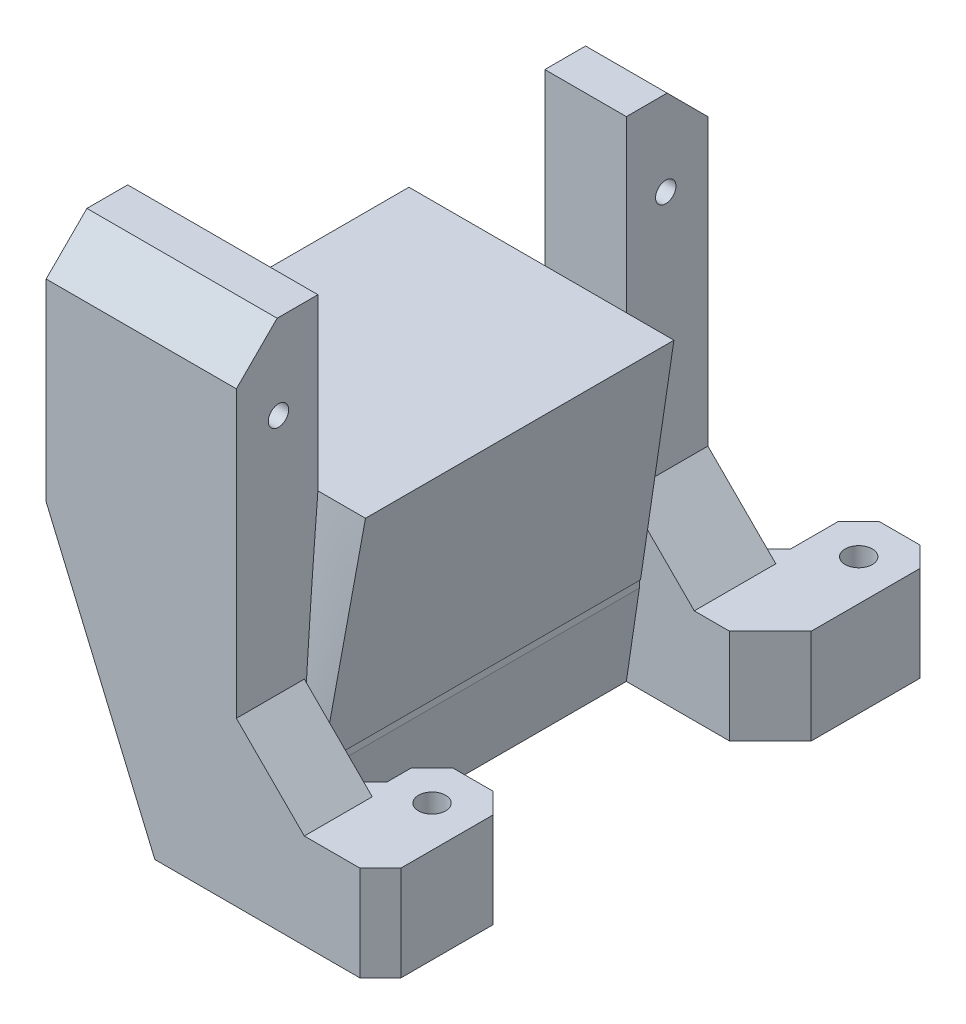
ISO-10303-21;
HEADER;
FILE_DESCRIPTION(('STEP AP214'),'2;1');
FILE_NAME('part.step','',(''),(''),'','','');
FILE_SCHEMA(('AUTOMOTIVE_DESIGN { 1 0 10303 214 1 1 1 1 }'));
ENDSEC;
DATA;
#1=APPLICATION_CONTEXT('core data for automotive mechanical design processes');
#2=APPLICATION_PROTOCOL_DEFINITION('international standard','automotive_design',2000,#1);
#3=PRODUCT_CONTEXT('',#1,'mechanical');
#4=PRODUCT('Part','Part','',(#3));
#5=PRODUCT_RELATED_PRODUCT_CATEGORY('part','',(#4));
#6=PRODUCT_DEFINITION_FORMATION('','',#4);
#7=PRODUCT_DEFINITION_CONTEXT('part definition',#1,'design');
#8=PRODUCT_DEFINITION('design','',#6,#7);
#9=PRODUCT_DEFINITION_SHAPE('','',#8);
#10=(LENGTH_UNIT() NAMED_UNIT(*) SI_UNIT(.MILLI.,.METRE.));
#11=(NAMED_UNIT(*) PLANE_ANGLE_UNIT() SI_UNIT($,.RADIAN.));
#12=(NAMED_UNIT(*) SI_UNIT($,.STERADIAN.) SOLID_ANGLE_UNIT());
#13=UNCERTAINTY_MEASURE_WITH_UNIT(LENGTH_MEASURE(1.E-05),#10,'distance_accuracy_value','');
#14=(GEOMETRIC_REPRESENTATION_CONTEXT(3) GLOBAL_UNCERTAINTY_ASSIGNED_CONTEXT((#13)) GLOBAL_UNIT_ASSIGNED_CONTEXT((#10,
#11,#12)) REPRESENTATION_CONTEXT('',''));
#15=CARTESIAN_POINT('',(0.,0.,0.));
#16=DIRECTION('',(0.,0.,1.));
#17=DIRECTION('',(1.,0.,0.));
#18=AXIS2_PLACEMENT_3D('',#15,#16,#17);
#19=CARTESIAN_POINT('',(11.0000000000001,-29.,12.35));
#20=DIRECTION('',(0.,1.,0.));
#21=DIRECTION('',(-1.,0.,0.));
#22=AXIS2_PLACEMENT_3D('',#19,#20,#21);
#23=PLANE('',#22);
#24=DIRECTION('',(-0.707106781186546,0.,0.707106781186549));
#25=VECTOR('',#24,1.);
#26=CARTESIAN_POINT('',(16.6,-29.,15.85));
#27=LINE('',#26,#25);
#28=CARTESIAN_POINT('',(16.6,-29.,15.85));
#29=VERTEX_POINT('',#28);
#30=CARTESIAN_POINT('',(15.1,-29.,17.35));
#31=VERTEX_POINT('',#30);
#32=EDGE_CURVE('E831',#29,#31,#27,.T.);
#33=ORIENTED_EDGE('',*,*,#32,.F.);
#34=DIRECTION('',(0.,0.,1.));
#35=VECTOR('',#34,1.);
#36=CARTESIAN_POINT('',(16.6,-29.,15.85));
#37=LINE('',#36,#35);
#38=CARTESIAN_POINT('',(16.6,-29.,9.05000000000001));
#39=VERTEX_POINT('',#38);
#40=EDGE_CURVE('E828',#39,#29,#37,.T.);
#41=ORIENTED_EDGE('',*,*,#40,.F.);
#42=DIRECTION('',(0.707106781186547,0.,0.707106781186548));
#43=VECTOR('',#42,1.);
#44=CARTESIAN_POINT('',(15.1,-29.,7.55000000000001));
#45=LINE('',#44,#43);
#46=CARTESIAN_POINT('',(15.1,-29.,7.55000000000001));
#47=VERTEX_POINT('',#46);
#48=EDGE_CURVE('E825',#47,#39,#45,.T.);
#49=ORIENTED_EDGE('',*,*,#48,.F.);
#50=DIRECTION('',(1.,0.,0.));
#51=VECTOR('',#50,1.);
#52=CARTESIAN_POINT('',(12.1,-29.,7.55000000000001));
#53=LINE('',#52,#51);
#54=CARTESIAN_POINT('',(12.1,-29.,7.55000000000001));
#55=VERTEX_POINT('',#54);
#56=EDGE_CURVE('E822',#55,#47,#53,.T.);
#57=ORIENTED_EDGE('',*,*,#56,.F.);
#58=DIRECTION('',(0.707106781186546,0.,-0.707106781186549));
#59=VECTOR('',#58,1.);
#60=CARTESIAN_POINT('',(10.6,-29.,9.05000000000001));
#61=LINE('',#60,#59);
#62=CARTESIAN_POINT('',(10.6,-29.,9.05000000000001));
#63=VERTEX_POINT('',#62);
#64=EDGE_CURVE('E819',#63,#55,#61,.T.);
#65=ORIENTED_EDGE('',*,*,#64,.F.);
#66=DIRECTION('',(0.,0.,-1.));
#67=VECTOR('',#66,1.);
#68=CARTESIAN_POINT('',(10.6,-29.,10.85));
#69=LINE('',#68,#67);
#70=CARTESIAN_POINT('',(10.6,-29.,10.85));
#71=VERTEX_POINT('',#70);
#72=EDGE_CURVE('E816',#71,#63,#69,.T.);
#73=ORIENTED_EDGE('',*,*,#72,.F.);
#74=DIRECTION('',(0.707106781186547,0.,-0.707106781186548));
#75=VECTOR('',#74,1.);
#76=CARTESIAN_POINT('',(10.6,-29.,10.85));
#77=LINE('',#76,#75);
#78=CARTESIAN_POINT('',(9.10000000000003,-29.,12.35));
#79=VERTEX_POINT('',#78);
#80=EDGE_CURVE('E813',#79,#71,#77,.T.);
#81=ORIENTED_EDGE('',*,*,#80,.F.);
#82=DIRECTION('',(-1.,0.,0.));
#83=VECTOR('',#82,1.);
#84=CARTESIAN_POINT('',(7.00000000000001,-29.,12.35));
#85=LINE('',#84,#83);
#86=CARTESIAN_POINT('',(11.0000000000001,-29.,12.35));
#87=VERTEX_POINT('',#86);
#88=EDGE_CURVE('E701',#87,#79,#85,.T.);
#89=ORIENTED_EDGE('',*,*,#88,.F.);
#90=DIRECTION('',(0.,0.,1.));
#91=VECTOR('',#90,1.);
#92=CARTESIAN_POINT('',(11.0000000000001,-29.,12.35));
#93=LINE('',#92,#91);
#94=CARTESIAN_POINT('',(11.0000000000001,-29.,17.35));
#95=VERTEX_POINT('',#94);
#96=EDGE_CURVE('E734',#87,#95,#93,.T.);
#97=ORIENTED_EDGE('',*,*,#96,.T.);
#98=DIRECTION('',(-1.,0.,0.));
#99=VECTOR('',#98,1.);
#100=CARTESIAN_POINT('',(11.0000000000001,-29.,17.35));
#101=LINE('',#100,#99);
#102=EDGE_CURVE('E738',#31,#95,#101,.T.);
#103=ORIENTED_EDGE('',*,*,#102,.F.);
#104=EDGE_LOOP('',(#33,#41,#49,#57,#65,#73,#81,#89,#97,#103));
#105=FACE_BOUND('',#104,.T.);
#106=CARTESIAN_POINT('',(13.6,-29.,10.55));
#107=DIRECTION('',(0.,1.,0.));
#108=DIRECTION('',(-1.,0.,0.));
#109=AXIS2_PLACEMENT_3D('',#106,#107,#108);
#110=CIRCLE('',#109,1.);
#111=CARTESIAN_POINT('',(12.6,-29.,10.55));
#112=VERTEX_POINT('',#111);
#113=EDGE_CURVE('E705',#112,#112,#110,.T.);
#114=ORIENTED_EDGE('',*,*,#113,.F.);
#115=EDGE_LOOP('',(#114));
#116=FACE_BOUND('',#115,.T.);
#117=ADVANCED_FACE('F152',(#105,#116),#23,.T.);
#118=CARTESIAN_POINT('',(9.5,-12.5,-11.35));
#119=DIRECTION('',(0.989090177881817,-0.147311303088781,0.));
#120=DIRECTION('',(0.,0.,1.));
#121=AXIS2_PLACEMENT_3D('',#118,#119,#120);
#122=PLANE('',#121);
#123=DIRECTION('',(0.,0.,-1.));
#124=VECTOR('',#123,1.);
#125=CARTESIAN_POINT('',(6.95744680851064,-29.5714285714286,-11.35));
#126=LINE('',#125,#124);
#127=CARTESIAN_POINT('',(6.95744680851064,-29.5714285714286,12.076443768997));
#128=VERTEX_POINT('',#127);
#129=CARTESIAN_POINT('',(6.95744680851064,-29.5714285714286,-11.35));
#130=VERTEX_POINT('',#129);
#131=EDGE_CURVE('E677',#128,#130,#126,.T.);
#132=ORIENTED_EDGE('',*,*,#131,.F.);
#133=DIRECTION('',(-0.147180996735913,-0.988215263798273,0.0420517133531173));
#134=VECTOR('',#133,1.);
#135=CARTESIAN_POINT('',(7.75,-24.25,11.85));
#136=LINE('',#135,#134);
#137=CARTESIAN_POINT('',(6.,-36.,12.35));
#138=VERTEX_POINT('',#137);
#139=EDGE_CURVE('E993',#128,#138,#136,.T.);
#140=ORIENTED_EDGE('',*,*,#139,.T.);
#141=DIRECTION('',(0.,0.,1.));
#142=VECTOR('',#141,1.);
#143=CARTESIAN_POINT('',(6.,-36.,-11.35));
#144=LINE('',#143,#142);
#145=CARTESIAN_POINT('',(6.,-36.,-11.35));
#146=VERTEX_POINT('',#145);
#147=EDGE_CURVE('E766',#138,#146,#144,.F.);
#148=ORIENTED_EDGE('',*,*,#147,.T.);
#149=DIRECTION('',(-0.147311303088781,-0.989090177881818,0.));
#150=VECTOR('',#149,1.);
#151=CARTESIAN_POINT('',(7.75,-24.25,-11.35));
#152=LINE('',#151,#150);
#153=EDGE_CURVE('E1023',#130,#146,#152,.T.);
#154=ORIENTED_EDGE('',*,*,#153,.F.);
#155=EDGE_LOOP('',(#132,#140,#148,#154));
#156=FACE_BOUND('',#155,.T.);
#157=ADVANCED_FACE('F913',(#156),#122,.T.);
#158=CARTESIAN_POINT('',(6.,-12.5,10.35));
#159=DIRECTION('',(1.,0.,0.));
#160=DIRECTION('',(0.,0.,-1.));
#161=AXIS2_PLACEMENT_3D('',#158,#159,#160);
#162=PLANE('',#161);
#163=DIRECTION('',(0.,-0.707106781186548,-0.707106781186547));
#164=VECTOR('',#163,1.);
#165=CARTESIAN_POINT('',(6.,0.,-14.35));
#166=LINE('',#165,#164);
#167=CARTESIAN_POINT('',(6.,0.,-14.35));
#168=VERTEX_POINT('',#167);
#169=CARTESIAN_POINT('',(6.,-3.00000000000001,-17.35));
#170=VERTEX_POINT('',#169);
#171=EDGE_CURVE('E775',#168,#170,#166,.T.);
#172=ORIENTED_EDGE('',*,*,#171,.F.);
#173=DIRECTION('',(0.,0.,1.));
#174=VECTOR('',#173,1.);
#175=CARTESIAN_POINT('',(6.,0.,-11.35));
#176=LINE('',#175,#174);
#177=CARTESIAN_POINT('',(6.,0.,-11.35));
#178=VERTEX_POINT('',#177);
#179=EDGE_CURVE('E1071',#168,#178,#176,.T.);
#180=ORIENTED_EDGE('',*,*,#179,.T.);
#181=DIRECTION('',(0.,-1.,0.));
#182=VECTOR('',#181,1.);
#183=CARTESIAN_POINT('',(6.,-12.5,-11.35));
#184=LINE('',#183,#182);
#185=CARTESIAN_POINT('',(6.,-12.5,-11.35));
#186=VERTEX_POINT('',#185);
#187=EDGE_CURVE('E523',#178,#186,#184,.T.);
#188=ORIENTED_EDGE('',*,*,#187,.T.);
#189=CARTESIAN_POINT('',(6.,-36.,-11.35));
#190=CARTESIAN_POINT('',(6.,-35.8180285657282,-11.3770863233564));
#191=CARTESIAN_POINT('',(6.,-35.6357740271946,-11.4022004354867));
#192=CARTESIAN_POINT('',(6.,-35.2708351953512,-11.4489451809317));
#193=CARTESIAN_POINT('',(6.,-35.0881509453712,-11.4705761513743));
#194=CARTESIAN_POINT('',(6.,-34.7226207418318,-11.5108022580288));
#195=CARTESIAN_POINT('',(6.,-34.5397750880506,-11.5294001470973));
#196=CARTESIAN_POINT('',(6.,-34.1738310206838,-11.5639527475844));
#197=CARTESIAN_POINT('',(6.,-33.990732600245,-11.57990738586));
#198=CARTESIAN_POINT('',(6.,-33.4412314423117,-11.6242925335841));
#199=CARTESIAN_POINT('',(6.,-33.0745471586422,-11.6492523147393));
#200=CARTESIAN_POINT('',(6.,-32.3413111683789,-11.6919012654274));
#201=CARTESIAN_POINT('',(6.,-31.9747600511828,-11.7096010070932));
#202=CARTESIAN_POINT('',(6.,-31.2413537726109,-11.7392453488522));
#203=CARTESIAN_POINT('',(6.,-30.8744985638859,-11.7511887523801));
#204=CARTESIAN_POINT('',(6.,-30.140644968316,-11.77041819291));
#205=CARTESIAN_POINT('',(6.,-29.7736465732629,-11.7777039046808));
#206=CARTESIAN_POINT('',(6.,-29.0408009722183,-11.7884389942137));
#207=CARTESIAN_POINT('',(6.,-28.674953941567,-11.7919008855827));
#208=CARTESIAN_POINT('',(6.,-27.9432777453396,-11.7956762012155));
#209=CARTESIAN_POINT('',(6.,-27.5774485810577,-11.7959899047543));
#210=CARTESIAN_POINT('',(6.,-26.8458063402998,-11.793977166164));
#211=CARTESIAN_POINT('',(6.,-26.4799932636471,-11.791650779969));
#212=CARTESIAN_POINT('',(6.,-25.7481234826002,-11.7847599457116));
#213=CARTESIAN_POINT('',(6.,-25.3820667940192,-11.7801938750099));
#214=CARTESIAN_POINT('',(6.,-24.6499753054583,-11.7691497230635));
#215=CARTESIAN_POINT('',(6.,-24.2839405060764,-11.7626716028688));
#216=CARTESIAN_POINT('',(6.,-23.5519013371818,-11.7480694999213));
#217=CARTESIAN_POINT('',(6.,-23.185896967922,-11.7399455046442));
#218=CARTESIAN_POINT('',(6.,-22.3894125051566,-11.720713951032));
#219=CARTESIAN_POINT('',(6.,-21.9589390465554,-11.7093329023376));
#220=CARTESIAN_POINT('',(6.,-21.0980425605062,-11.6848903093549));
#221=CARTESIAN_POINT('',(6.,-20.6676195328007,-11.6718287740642));
#222=CARTESIAN_POINT('',(6.,-19.8068192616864,-11.6442615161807));
#223=CARTESIAN_POINT('',(6.,-19.3764420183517,-11.6297557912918));
#224=CARTESIAN_POINT('',(6.,-18.5157301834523,-11.5994944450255));
#225=CARTESIAN_POINT('',(6.,-18.0853955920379,-11.5837388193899));
#226=CARTESIAN_POINT('',(6.,-17.225411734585,-11.5511630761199));
#227=CARTESIAN_POINT('',(6.,-16.7957624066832,-11.5343445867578));
#228=CARTESIAN_POINT('',(6.,-15.9365032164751,-11.4997556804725));
#229=CARTESIAN_POINT('',(6.,-15.5068933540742,-11.481985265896));
#230=CARTESIAN_POINT('',(6.,-14.6477133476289,-11.4456061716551));
#231=CARTESIAN_POINT('',(6.,-14.2181432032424,-11.4269975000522));
#232=CARTESIAN_POINT('',(6.,-13.3590436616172,-11.3890347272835));
#233=CARTESIAN_POINT('',(6.,-12.9295142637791,-11.3696806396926));
#234=CARTESIAN_POINT('',(6.,-12.5,-11.35));
#235=B_SPLINE_CURVE_WITH_KNOTS('',3,(#189,#190,#191,#192,#193,#194,#195,#196,#197,#198,#199,
#200,#201,#202,#203,#204,#205,#206,#207,#208,#209,#210,#211,#212,#213,#214,#215,#216,#217,#218,
#219,#220,#221,#222,#223,#224,#225,#226,#227,#228,#229,#230,#231,#232,#233,#234),.UNSPECIFIED.,
.F.,.F.,(4,2,2,2,2,2,2,2,2,2,2,2,2,2,2,2,2,2,2,2,2,2,4),(0.,0.551903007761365,1.1037525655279,
1.65509843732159,2.20645956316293,3.30895366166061,4.40983654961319,5.51094817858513,
6.61213668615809,7.70971073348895,8.80718741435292,9.90464084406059,11.0028905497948,
12.1011626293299,13.1994430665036,14.4913107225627,15.7831714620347,17.0750342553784,
18.3669014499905,19.6568353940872,20.9467661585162,22.2366845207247,23.5265794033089),.UNSPECIFIED.);
#236=CARTESIAN_POINT('',(6.,-24.,-11.7569938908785));
#237=VERTEX_POINT('',#236);
#238=EDGE_CURVE('E651',#237,#186,#235,.T.);
#239=ORIENTED_EDGE('',*,*,#238,.F.);
#240=DIRECTION('',(0.,0.,-1.));
#241=VECTOR('',#240,1.);
#242=CARTESIAN_POINT('',(6.,-24.,-11.35));
#243=LINE('',#242,#241);
#244=CARTESIAN_POINT('',(6.,-24.,-17.35));
#245=VERTEX_POINT('',#244);
#246=EDGE_CURVE('E712',#237,#245,#243,.T.);
#247=ORIENTED_EDGE('',*,*,#246,.T.);
#248=DIRECTION('',(0.,1.,0.));
#249=VECTOR('',#248,1.);
#250=CARTESIAN_POINT('',(6.,0.,-17.35));
#251=LINE('',#250,#249);
#252=EDGE_CURVE('E761',#245,#170,#251,.T.);
#253=ORIENTED_EDGE('',*,*,#252,.T.);
#254=EDGE_LOOP('',(#172,#180,#188,#239,#247,#253));
#255=FACE_BOUND('',#254,.T.);
#256=CARTESIAN_POINT('',(6.,-6.25,-14.25));
#257=DIRECTION('',(1.,0.,0.));
#258=DIRECTION('',(0.,0.,-1.));
#259=AXIS2_PLACEMENT_3D('',#256,#257,#258);
#260=CIRCLE('',#259,0.75);
#261=CARTESIAN_POINT('',(6.,-6.25,-15.));
#262=VERTEX_POINT('',#261);
#263=EDGE_CURVE('E749',#262,#262,#260,.T.);
#264=ORIENTED_EDGE('',*,*,#263,.F.);
#265=EDGE_LOOP('',(#264));
#266=FACE_BOUND('',#265,.T.);
#267=ADVANCED_FACE('F640',(#255,#266),#162,.T.);
#268=CARTESIAN_POINT('',(0.,-12.5,10.35));
#269=DIRECTION('',(1.,0.,0.));
#270=DIRECTION('',(0.,0.,-1.));
#271=AXIS2_PLACEMENT_3D('',#268,#269,#270);
#272=PLANE('',#271);
#273=CARTESIAN_POINT('',(0.,-6.25,-14.25));
#274=DIRECTION('',(1.,0.,0.));
#275=DIRECTION('',(0.,0.,-1.));
#276=AXIS2_PLACEMENT_3D('',#273,#274,#275);
#277=CIRCLE('',#276,0.75);
#278=CARTESIAN_POINT('',(0.,-6.25,-15.));
#279=VERTEX_POINT('',#278);
#280=EDGE_CURVE('E733',#279,#279,#277,.T.);
#281=ORIENTED_EDGE('',*,*,#280,.T.);
#282=EDGE_LOOP('',(#281));
#283=FACE_BOUND('',#282,.T.);
#284=DIRECTION('',(0.,0.,1.));
#285=VECTOR('',#284,1.);
#286=CARTESIAN_POINT('',(0.,0.,-11.35));
#287=LINE('',#286,#285);
#288=CARTESIAN_POINT('',(0.,0.,-14.35));
#289=VERTEX_POINT('',#288);
#290=CARTESIAN_POINT('',(0.,0.,-11.35));
#291=VERTEX_POINT('',#290);
#292=EDGE_CURVE('E1607',#289,#291,#287,.T.);
#293=ORIENTED_EDGE('',*,*,#292,.F.);
#294=DIRECTION('',(0.,-0.707106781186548,-0.707106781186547));
#295=VECTOR('',#294,1.);
#296=CARTESIAN_POINT('',(0.,6.09999999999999,-8.25000000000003));
#297=LINE('',#296,#295);
#298=CARTESIAN_POINT('',(0.,-3.00000000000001,-17.35));
#299=VERTEX_POINT('',#298);
#300=EDGE_CURVE('E169',#289,#299,#297,.T.);
#301=ORIENTED_EDGE('',*,*,#300,.T.);
#302=DIRECTION('',(0.,1.,0.));
#303=VECTOR('',#302,1.);
#304=CARTESIAN_POINT('',(0.,0.,-17.35));
#305=LINE('',#304,#303);
#306=CARTESIAN_POINT('',(0.,-36.,-17.35));
#307=VERTEX_POINT('',#306);
#308=EDGE_CURVE('E421',#307,#299,#305,.T.);
#309=ORIENTED_EDGE('',*,*,#308,.F.);
#310=CARTESIAN_POINT('',(0.,-36.,-17.35));
#311=CARTESIAN_POINT('',(0.,-35.714897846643,-17.1558635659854));
#312=CARTESIAN_POINT('',(0.,-35.4232476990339,-16.9716745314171));
#313=CARTESIAN_POINT('',(0.,-34.8307268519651,-16.6223277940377));
#314=CARTESIAN_POINT('',(0.,-34.5299104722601,-16.4570782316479));
#315=CARTESIAN_POINT('',(0.,-33.9206322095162,-16.1431428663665));
#316=CARTESIAN_POINT('',(0.,-33.612187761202,-15.9944229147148));
#317=CARTESIAN_POINT('',(0.,-32.9889615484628,-15.7112897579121));
#318=CARTESIAN_POINT('',(0.,-32.6741819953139,-15.5768716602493));
#319=CARTESIAN_POINT('',(0.,-32.0427881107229,-15.3217556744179));
#320=CARTESIAN_POINT('',(0.,-31.7262233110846,-15.2009344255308));
#321=CARTESIAN_POINT('',(0.,-31.0889647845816,-14.9697726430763));
#322=CARTESIAN_POINT('',(0.,-30.768267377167,-14.8594423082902));
#323=CARTESIAN_POINT('',(0.,-30.1236418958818,-14.647899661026));
#324=CARTESIAN_POINT('',(0.,-29.7997116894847,-14.5466938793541));
#325=CARTESIAN_POINT('',(0.,-29.1494509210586,-14.352247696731));
#326=CARTESIAN_POINT('',(0.,-28.8231201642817,-14.2590079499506));
#327=CARTESIAN_POINT('',(0.,-28.1706992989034,-14.0800312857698));
#328=CARTESIAN_POINT('',(0.,-27.8446214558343,-13.994249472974));
#329=CARTESIAN_POINT('',(0.,-27.1911233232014,-13.8286713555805));
#330=CARTESIAN_POINT('',(0.,-26.8637037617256,-13.7488721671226));
#331=CARTESIAN_POINT('',(0.,-26.2077152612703,-13.5944786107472));
#332=CARTESIAN_POINT('',(0.,-25.8791465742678,-13.5198831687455));
#333=CARTESIAN_POINT('',(0.,-25.2210236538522,-13.3752426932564));
#334=CARTESIAN_POINT('',(0.,-24.8914694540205,-13.3051975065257));
#335=CARTESIAN_POINT('',(0.,-24.2301635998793,-13.1688267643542));
#336=CARTESIAN_POINT('',(0.,-23.8984085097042,-13.1025179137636));
#337=CARTESIAN_POINT('',(0.,-23.2341802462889,-12.9734600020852));
#338=CARTESIAN_POINT('',(0.,-22.9017070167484,-12.9107112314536));
#339=CARTESIAN_POINT('',(0.,-22.236160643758,-12.7883715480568));
#340=CARTESIAN_POINT('',(0.,-21.9030874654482,-12.7287808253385));
#341=CARTESIAN_POINT('',(0.,-21.2364488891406,-12.6124132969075));
#342=CARTESIAN_POINT('',(0.,-20.9028834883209,-12.5556365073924));
#343=CARTESIAN_POINT('',(0.,-20.2330268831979,-12.4442130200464));
#344=CARTESIAN_POINT('',(0.,-19.8967327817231,-12.3895837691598));
#345=CARTESIAN_POINT('',(0.,-19.2237953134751,-12.2826107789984));
#346=CARTESIAN_POINT('',(0.,-18.8871519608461,-12.2302669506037));
#347=CARTESIAN_POINT('',(0.,-18.2135574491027,-12.1276324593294));
#348=CARTESIAN_POINT('',(0.,-17.8766062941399,-12.077341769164));
#349=CARTESIAN_POINT('',(0.,-17.2024330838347,-11.9786114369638));
#350=CARTESIAN_POINT('',(0.,-16.8652110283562,-11.930171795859));
#351=CARTESIAN_POINT('',(0.,-16.1926089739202,-11.8352604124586));
#352=CARTESIAN_POINT('',(0.,-15.8572304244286,-11.7887783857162));
#353=CARTESIAN_POINT('',(0.,-15.1862677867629,-11.6973162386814));
#354=CARTESIAN_POINT('',(0.,-14.8506836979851,-11.652336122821));
#355=CARTESIAN_POINT('',(0.,-14.1793377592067,-11.5637430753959));
#356=CARTESIAN_POINT('',(0.,-13.8435759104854,-11.5201301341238));
#357=CARTESIAN_POINT('',(0.,-13.1718993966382,-11.4341557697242));
#358=CARTESIAN_POINT('',(0.,-12.835984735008,-11.3917943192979));
#359=CARTESIAN_POINT('',(0.,-12.5,-11.35));
#360=B_SPLINE_CURVE_WITH_KNOTS('',3,(#310,#311,#312,#313,#314,#315,#316,#317,#318,#319,#320,
#321,#322,#323,#324,#325,#326,#327,#328,#329,#330,#331,#332,#333,#334,#335,#336,#337,#338,#339,
#340,#341,#342,#343,#344,#345,#346,#347,#348,#349,#350,#351,#352,#353,#354,#355,#356,#357,#358,
#359),.UNSPECIFIED.,.F.,.F.,(4,2,2,2,2,2,2,2,2,2,2,2,2,2,2,2,2,2,2,2,2,2,2,2,4),(0.,
1.03429565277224,2.0633410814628,3.09021944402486,4.11674538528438,5.1330432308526,
6.15031918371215,7.16831755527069,8.18639944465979,9.19785305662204,10.2088159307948,
11.219569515,12.2302890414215,13.2452176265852,14.2602288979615,15.2753011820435,
16.2903793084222,17.3124775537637,18.3345359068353,19.3565806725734,20.3786259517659,
21.394375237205,22.4101275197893,23.4258725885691,24.4415954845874),.UNSPECIFIED.);
#361=CARTESIAN_POINT('',(0.,-12.5,-11.35));
#362=VERTEX_POINT('',#361);
#363=EDGE_CURVE('E653',#307,#362,#360,.T.);
#364=ORIENTED_EDGE('',*,*,#363,.T.);
#365=DIRECTION('',(0.,-1.,0.));
#366=VECTOR('',#365,1.);
#367=CARTESIAN_POINT('',(0.,-12.5,-11.35));
#368=LINE('',#367,#366);
#369=EDGE_CURVE('E767',#291,#362,#368,.T.);
#370=ORIENTED_EDGE('',*,*,#369,.F.);
#371=EDGE_LOOP('',(#293,#301,#309,#364,#370));
#372=FACE_BOUND('',#371,.T.);
#373=ADVANCED_FACE('F638',(#283,#372),#272,.F.);
#374=DIRECTION('',(0.,0.707106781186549,-0.707106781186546));
#375=VECTOR('',#374,1.);
#376=CARTESIAN_POINT('',(6.,0.,14.35));
#377=LINE('',#376,#375);
#378=CARTESIAN_POINT('',(6.,-3.00000000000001,17.35));
#379=VERTEX_POINT('',#378);
#380=CARTESIAN_POINT('',(6.,0.,14.35));
#381=VERTEX_POINT('',#380);
#382=EDGE_CURVE('E782',#379,#381,#377,.T.);
#383=ORIENTED_EDGE('',*,*,#382,.F.);
#384=DIRECTION('',(0.,-1.,0.));
#385=VECTOR('',#384,1.);
#386=CARTESIAN_POINT('',(6.,-36.,17.35));
#387=LINE('',#386,#385);
#388=CARTESIAN_POINT('',(6.,-24.,17.35));
#389=VERTEX_POINT('',#388);
#390=EDGE_CURVE('E764',#379,#389,#387,.T.);
#391=ORIENTED_EDGE('',*,*,#390,.T.);
#392=DIRECTION('',(0.,0.,1.));
#393=VECTOR('',#392,1.);
#394=CARTESIAN_POINT('',(6.,-24.,12.35));
#395=LINE('',#394,#393);
#396=CARTESIAN_POINT('',(6.,-24.,12.35));
#397=VERTEX_POINT('',#396);
#398=EDGE_CURVE('E730',#397,#389,#395,.T.);
#399=ORIENTED_EDGE('',*,*,#398,.F.);
#400=DIRECTION('',(0.,-1.,0.));
#401=VECTOR('',#400,1.);
#402=CARTESIAN_POINT('',(6.,-24.,12.35));
#403=LINE('',#402,#401);
#404=CARTESIAN_POINT('',(6.,-27.2822580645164,12.35));
#405=VERTEX_POINT('',#404);
#406=EDGE_CURVE('E719',#397,#405,#403,.T.);
#407=ORIENTED_EDGE('',*,*,#406,.T.);
#408=CARTESIAN_POINT('',(6.,-12.5,11.35));
#409=CARTESIAN_POINT('',(6.,-13.0254348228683,11.3924197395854));
#410=CARTESIAN_POINT('',(6.,-13.550902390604,11.4344374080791));
#411=CARTESIAN_POINT('',(6.,-14.6019161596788,11.5175211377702));
#412=CARTESIAN_POINT('',(6.,-15.1274623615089,11.558587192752));
#413=CARTESIAN_POINT('',(6.,-16.1786404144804,11.6396197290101));
#414=CARTESIAN_POINT('',(6.,-16.7042722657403,11.6795862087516));
#415=CARTESIAN_POINT('',(6.,-17.7560958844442,11.7582641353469));
#416=CARTESIAN_POINT('',(6.,-18.2822877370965,11.7969744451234));
#417=CARTESIAN_POINT('',(6.,-19.3347814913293,11.8728684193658));
#418=CARTESIAN_POINT('',(6.,-19.8610833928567,11.9100520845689));
#419=CARTESIAN_POINT('',(6.,-20.9138156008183,11.9825980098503));
#420=CARTESIAN_POINT('',(6.,-21.4402459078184,12.0179602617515));
#421=CARTESIAN_POINT('',(6.,-22.3555945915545,12.0775256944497));
#422=CARTESIAN_POINT('',(6.,-22.7444803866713,12.1022291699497));
#423=CARTESIAN_POINT('',(6.,-23.5223360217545,12.1502433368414));
#424=CARTESIAN_POINT('',(6.,-23.9113058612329,12.1735540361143));
#425=CARTESIAN_POINT('',(6.,-24.6893336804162,12.2185498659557));
#426=CARTESIAN_POINT('',(6.,-25.0783916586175,12.2402350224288));
#427=CARTESIAN_POINT('',(6.,-25.8564214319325,12.2816820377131));
#428=CARTESIAN_POINT('',(6.,-26.2453931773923,12.3014448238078));
#429=CARTESIAN_POINT('',(6.,-27.02345250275,12.3386996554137));
#430=CARTESIAN_POINT('',(6.,-27.4125400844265,12.356191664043));
#431=CARTESIAN_POINT('',(6.,-28.1908558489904,12.3884498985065));
#432=CARTESIAN_POINT('',(6.,-28.5800840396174,12.4032159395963));
#433=CARTESIAN_POINT('',(6.,-29.359745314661,12.4294713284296));
#434=CARTESIAN_POINT('',(6.,-29.7501787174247,12.4409513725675));
#435=CARTESIAN_POINT('',(6.,-30.531127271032,12.4598066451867));
#436=CARTESIAN_POINT('',(6.,-30.9216424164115,12.4671820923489));
#437=CARTESIAN_POINT('',(6.,-31.7026775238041,12.4767971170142));
#438=CARTESIAN_POINT('',(6.,-32.0931974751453,12.4790375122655));
#439=CARTESIAN_POINT('',(6.,-32.8746393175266,12.4769915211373));
#440=CARTESIAN_POINT('',(6.,-33.2655612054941,12.4726983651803));
#441=CARTESIAN_POINT('',(6.,-33.8518331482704,12.4598696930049));
#442=CARTESIAN_POINT('',(6.,-34.0472537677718,12.4545279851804));
#443=CARTESIAN_POINT('',(6.,-34.4380092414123,12.4413840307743));
#444=CARTESIAN_POINT('',(6.,-34.6333440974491,12.4335818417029));
#445=CARTESIAN_POINT('',(6.,-35.0240212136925,12.4151343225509));
#446=CARTESIAN_POINT('',(6.,-35.2193633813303,12.4044869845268));
#447=CARTESIAN_POINT('',(6.,-35.6098523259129,12.3798627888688));
#448=CARTESIAN_POINT('',(6.,-35.8049990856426,12.3658856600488));
#449=CARTESIAN_POINT('',(6.,-36.,12.35));
#450=B_SPLINE_CURVE_WITH_KNOTS('',3,(#408,#409,#410,#411,#412,#413,#414,#415,#416,#417,#418,
#419,#420,#421,#422,#423,#424,#425,#426,#427,#428,#429,#430,#431,#432,#433,#434,#435,#436,#437,
#438,#439,#440,#441,#442,#443,#444,#445,#446,#447,#448,#449),.UNSPECIFIED.,.F.,.F.,(4,2,2,2,2,2,
2,2,2,2,2,2,2,2,2,2,2,2,2,2,4),(0.,1.5814333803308,3.16287708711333,4.74432300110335,
6.32716261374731,7.91000146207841,9.49284741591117,10.6618542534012,11.830854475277,
12.9998360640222,14.1682509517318,15.3366848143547,16.5051978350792,17.6769872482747,
18.8487142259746,20.0202545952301,21.1930096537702,21.7794779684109,22.3659325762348,
22.9528021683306,23.5397195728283),.UNSPECIFIED.);
#451=CARTESIAN_POINT('',(6.,-12.5,11.35));
#452=VERTEX_POINT('',#451);
#453=EDGE_CURVE('E607',#452,#405,#450,.T.);
#454=ORIENTED_EDGE('',*,*,#453,.F.);
#455=DIRECTION('',(0.,1.,0.));
#456=VECTOR('',#455,1.);
#457=CARTESIAN_POINT('',(6.,0.,11.35));
#458=LINE('',#457,#456);
#459=CARTESIAN_POINT('',(6.,0.,11.35));
#460=VERTEX_POINT('',#459);
#461=EDGE_CURVE('E520',#452,#460,#458,.T.);
#462=ORIENTED_EDGE('',*,*,#461,.T.);
#463=DIRECTION('',(0.,0.,1.));
#464=VECTOR('',#463,1.);
#465=CARTESIAN_POINT('',(6.,0.,17.35));
#466=LINE('',#465,#464);
#467=EDGE_CURVE('E522',#460,#381,#466,.T.);
#468=ORIENTED_EDGE('',*,*,#467,.T.);
#469=EDGE_LOOP('',(#383,#391,#399,#407,#454,#462,#468));
#470=FACE_BOUND('',#469,.T.);
#471=CARTESIAN_POINT('',(6.,-6.25,14.25));
#472=DIRECTION('',(1.,0.,0.));
#473=DIRECTION('',(0.,0.,-1.));
#474=AXIS2_PLACEMENT_3D('',#471,#472,#473);
#475=CIRCLE('',#474,0.75);
#476=CARTESIAN_POINT('',(6.,-6.25,13.5));
#477=VERTEX_POINT('',#476);
#478=EDGE_CURVE('E422',#477,#477,#475,.T.);
#479=ORIENTED_EDGE('',*,*,#478,.F.);
#480=EDGE_LOOP('',(#479));
#481=FACE_BOUND('',#480,.T.);
#482=ADVANCED_FACE('F633',(#470,#481),#162,.T.);
#483=CARTESIAN_POINT('',(0.,-6.25,14.25));
#484=DIRECTION('',(-1.,0.,0.));
#485=DIRECTION('',(0.,0.,1.));
#486=AXIS2_PLACEMENT_3D('',#483,#484,#485);
#487=CIRCLE('',#486,1.);
#488=CARTESIAN_POINT('',(0.,-6.25,15.25));
#489=VERTEX_POINT('',#488);
#490=EDGE_CURVE('E656',#489,#489,#487,.T.);
#491=ORIENTED_EDGE('',*,*,#490,.T.);
#492=EDGE_LOOP('',(#491));
#493=FACE_BOUND('',#492,.T.);
#494=CARTESIAN_POINT('',(0.,-6.25,14.25));
#495=DIRECTION('',(1.,0.,0.));
#496=DIRECTION('',(0.,0.,-1.));
#497=AXIS2_PLACEMENT_3D('',#494,#495,#496);
#498=CIRCLE('',#497,0.75);
#499=CARTESIAN_POINT('',(0.,-6.25,13.5));
#500=VERTEX_POINT('',#499);
#501=EDGE_CURVE('E752',#500,#500,#498,.T.);
#502=ORIENTED_EDGE('',*,*,#501,.T.);
#503=EDGE_LOOP('',(#502));
#504=FACE_BOUND('',#503,.T.);
#505=ADVANCED_FACE('F637',(#493,#504),#272,.F.);
#506=CARTESIAN_POINT('',(6.,-36.,17.35));
#507=DIRECTION('',(0.,0.,-1.));
#508=DIRECTION('',(0.,1.,0.));
#509=AXIS2_PLACEMENT_3D('',#506,#507,#508);
#510=PLANE('',#509);
#511=DIRECTION('',(0.,1.,0.));
#512=VECTOR('',#511,1.);
#513=CARTESIAN_POINT('',(-8.,0.,17.35));
#514=LINE('',#513,#512);
#515=CARTESIAN_POINT('',(-8.,-17.2,17.3500025));
#516=VERTEX_POINT('',#515);
#517=CARTESIAN_POINT('',(-8.,-3.00000000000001,17.35));
#518=VERTEX_POINT('',#517);
#519=EDGE_CURVE('E674',#516,#518,#514,.T.);
#520=ORIENTED_EDGE('',*,*,#519,.F.);
#521=DIRECTION('',(0.391555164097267,-0.920154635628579,0.));
#522=VECTOR('',#521,1.);
#523=CARTESIAN_POINT('',(0.919892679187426,-38.1617477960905,17.35));
#524=LINE('',#523,#522);
#525=CARTESIAN_POINT('',(0.,-36.,17.35));
#526=VERTEX_POINT('',#525);
#527=EDGE_CURVE('E772',#516,#526,#524,.T.);
#528=ORIENTED_EDGE('',*,*,#527,.T.);
#529=DIRECTION('',(-1.,0.,0.));
#530=VECTOR('',#529,1.);
#531=CARTESIAN_POINT('',(6.,-36.,17.35));
#532=LINE('',#531,#530);
#533=CARTESIAN_POINT('',(15.1,-36.,17.35));
#534=VERTEX_POINT('',#533);
#535=EDGE_CURVE('E411',#534,#526,#532,.T.);
#536=ORIENTED_EDGE('',*,*,#535,.F.);
#537=DIRECTION('',(0.,1.,0.));
#538=VECTOR('',#537,1.);
#539=CARTESIAN_POINT('',(15.1,-36.0001000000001,17.35));
#540=LINE('',#539,#538);
#541=EDGE_CURVE('E834',#534,#31,#540,.T.);
#542=ORIENTED_EDGE('',*,*,#541,.T.);
#543=ORIENTED_EDGE('',*,*,#102,.T.);
#544=DIRECTION('',(-0.707106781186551,0.707106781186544,0.));
#545=VECTOR('',#544,1.);
#546=CARTESIAN_POINT('',(11.0000000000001,-29.,17.35));
#547=LINE('',#546,#545);
#548=EDGE_CURVE('E724',#95,#389,#547,.T.);
#549=ORIENTED_EDGE('',*,*,#548,.T.);
#550=ORIENTED_EDGE('',*,*,#390,.F.);
#551=DIRECTION('',(1.,0.,0.));
#552=VECTOR('',#551,1.);
#553=CARTESIAN_POINT('',(-10.0001,-3.00000000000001,17.35));
#554=LINE('',#553,#552);
#555=EDGE_CURVE('E784',#518,#379,#554,.T.);
#556=ORIENTED_EDGE('',*,*,#555,.F.);
#557=EDGE_LOOP('',(#520,#528,#536,#542,#543,#549,#550,#556));
#558=FACE_BOUND('',#557,.T.);
#559=ADVANCED_FACE('F154',(#558),#510,.F.);
#560=CARTESIAN_POINT('',(6.,-36.,-17.35));
#561=DIRECTION('',(0.,1.,0.));
#562=DIRECTION('',(0.,0.,1.));
#563=AXIS2_PLACEMENT_3D('',#560,#561,#562);
#564=PLANE('',#563);
#565=ORIENTED_EDGE('',*,*,#535,.T.);
#566=DIRECTION('',(0.,0.,-1.));
#567=VECTOR('',#566,1.);
#568=CARTESIAN_POINT('',(0.,-36.,17.35005));
#569=LINE('',#568,#567);
#570=CARTESIAN_POINT('',(0.,-36.,11.35));
#571=VERTEX_POINT('',#570);
#572=EDGE_CURVE('E402',#526,#571,#569,.T.);
#573=ORIENTED_EDGE('',*,*,#572,.T.);
#574=CARTESIAN_POINT('',(0.,-36.,11.35));
#575=DIRECTION('',(0.,0.,-1.));
#576=VECTOR('',#575,1.);
#577=LINE('',#574,#576);
#578=EDGE_CURVE('E407',#571,#307,#577,.T.);
#579=ORIENTED_EDGE('',*,*,#578,.T.);
#580=DIRECTION('',(1.,0.,0.));
#581=VECTOR('',#580,1.);
#582=CARTESIAN_POINT('',(6.,-36.,-17.35));
#583=LINE('',#582,#581);
#584=CARTESIAN_POINT('',(9.10000000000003,-36.,-17.35));
#585=VERTEX_POINT('',#584);
#586=EDGE_CURVE('E873',#307,#585,#583,.T.);
#587=ORIENTED_EDGE('',*,*,#586,.T.);
#588=DIRECTION('',(0.707106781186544,0.,-0.707106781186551));
#589=VECTOR('',#588,1.);
#590=CARTESIAN_POINT('',(7.55000000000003,-36.,-15.8));
#591=LINE('',#590,#589);
#592=CARTESIAN_POINT('',(10.6,-36.,-18.85));
#593=VERTEX_POINT('',#592);
#594=EDGE_CURVE('E959',#585,#593,#591,.T.);
#595=ORIENTED_EDGE('',*,*,#594,.T.);
#596=DIRECTION('',(0.,0.,-1.));
#597=VECTOR('',#596,1.);
#598=CARTESIAN_POINT('',(10.6,-36.,-17.35));
#599=LINE('',#598,#597);
#600=CARTESIAN_POINT('',(10.6,-36.,-22.35));
#601=VERTEX_POINT('',#600);
#602=EDGE_CURVE('E965',#593,#601,#599,.T.);
#603=ORIENTED_EDGE('',*,*,#602,.T.);
#604=DIRECTION('',(0.707106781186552,0.,-0.707106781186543));
#605=VECTOR('',#604,1.);
#606=CARTESIAN_POINT('',(5.79999999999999,-36.,-17.55));
#607=LINE('',#606,#605);
#608=CARTESIAN_POINT('',(12.1,-36.,-23.85));
#609=VERTEX_POINT('',#608);
#610=EDGE_CURVE('E968',#601,#609,#607,.T.);
#611=ORIENTED_EDGE('',*,*,#610,.T.);
#612=DIRECTION('',(1.,0.,0.));
#613=VECTOR('',#612,1.);
#614=CARTESIAN_POINT('',(6.,-36.,-23.85));
#615=LINE('',#614,#613);
#616=CARTESIAN_POINT('',(15.1,-36.,-23.85));
#617=VERTEX_POINT('',#616);
#618=EDGE_CURVE('E971',#609,#617,#615,.T.);
#619=ORIENTED_EDGE('',*,*,#618,.T.);
#620=DIRECTION('',(0.707106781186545,0.,0.70710678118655));
#621=VECTOR('',#620,1.);
#622=CARTESIAN_POINT('',(13.8,-36.,-25.15));
#623=LINE('',#622,#621);
#624=CARTESIAN_POINT('',(16.6,-36.,-22.35));
#625=VERTEX_POINT('',#624);
#626=EDGE_CURVE('E974',#617,#625,#623,.T.);
#627=ORIENTED_EDGE('',*,*,#626,.T.);
#628=DIRECTION('',(0.,0.,1.));
#629=VECTOR('',#628,1.);
#630=CARTESIAN_POINT('',(16.6,-36.,-17.35));
#631=LINE('',#630,#629);
#632=CARTESIAN_POINT('',(16.6,-36.,-14.35));
#633=VERTEX_POINT('',#632);
#634=EDGE_CURVE('E955',#625,#633,#631,.T.);
#635=ORIENTED_EDGE('',*,*,#634,.T.);
#636=DIRECTION('',(-0.707106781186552,0.,0.707106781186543));
#637=VECTOR('',#636,1.);
#638=CARTESIAN_POINT('',(12.8,-36.,-10.55));
#639=LINE('',#638,#637);
#640=CARTESIAN_POINT('',(13.6,-36.,-11.35));
#641=VERTEX_POINT('',#640);
#642=EDGE_CURVE('E950',#633,#641,#639,.T.);
#643=ORIENTED_EDGE('',*,*,#642,.T.);
#644=DIRECTION('',(-1.,0.,0.));
#645=VECTOR('',#644,1.);
#646=CARTESIAN_POINT('',(52.,-36.,-11.35));
#647=LINE('',#646,#645);
#648=EDGE_CURVE('E711',#641,#146,#647,.T.);
#649=ORIENTED_EDGE('',*,*,#648,.T.);
#650=ORIENTED_EDGE('',*,*,#147,.F.);
#651=DIRECTION('',(1.,0.,0.));
#652=VECTOR('',#651,1.);
#653=CARTESIAN_POINT('',(6.,-36.,12.35));
#654=LINE('',#653,#652);
#655=CARTESIAN_POINT('',(9.10000000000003,-36.,12.35));
#656=VERTEX_POINT('',#655);
#657=EDGE_CURVE('E723',#138,#656,#654,.T.);
#658=ORIENTED_EDGE('',*,*,#657,.T.);
#659=DIRECTION('',(0.707106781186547,0.,-0.707106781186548));
#660=VECTOR('',#659,1.);
#661=CARTESIAN_POINT('',(22.4,-36.,-0.950000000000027));
#662=LINE('',#661,#660);
#663=CARTESIAN_POINT('',(10.6,-36.,10.85));
#664=VERTEX_POINT('',#663);
#665=EDGE_CURVE('E956',#656,#664,#662,.T.);
#666=ORIENTED_EDGE('',*,*,#665,.T.);
#667=DIRECTION('',(0.,0.,-1.));
#668=VECTOR('',#667,1.);
#669=CARTESIAN_POINT('',(10.6,-36.,-17.35));
#670=LINE('',#669,#668);
#671=CARTESIAN_POINT('',(10.6,-36.,9.05000000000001));
#672=VERTEX_POINT('',#671);
#673=EDGE_CURVE('E977',#664,#672,#670,.T.);
#674=ORIENTED_EDGE('',*,*,#673,.T.);
#675=DIRECTION('',(0.707106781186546,0.,-0.707106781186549));
#676=VECTOR('',#675,1.);
#677=CARTESIAN_POINT('',(21.5,-36.,-1.85000000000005));
#678=LINE('',#677,#676);
#679=CARTESIAN_POINT('',(12.1,-36.,7.55000000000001));
#680=VERTEX_POINT('',#679);
#681=EDGE_CURVE('E980',#672,#680,#678,.T.);
#682=ORIENTED_EDGE('',*,*,#681,.T.);
#683=DIRECTION('',(1.,0.,0.));
#684=VECTOR('',#683,1.);
#685=CARTESIAN_POINT('',(6.,-36.,7.55));
#686=LINE('',#685,#684);
#687=CARTESIAN_POINT('',(15.1,-36.,7.55000000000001));
#688=VERTEX_POINT('',#687);
#689=EDGE_CURVE('E983',#680,#688,#686,.T.);
#690=ORIENTED_EDGE('',*,*,#689,.T.);
#691=DIRECTION('',(0.707106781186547,0.,0.707106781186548));
#692=VECTOR('',#691,1.);
#693=CARTESIAN_POINT('',(-1.89999999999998,-36.,-9.45000000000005));
#694=LINE('',#693,#692);
#695=CARTESIAN_POINT('',(16.6,-36.,9.05000000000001));
#696=VERTEX_POINT('',#695);
#697=EDGE_CURVE('E986',#688,#696,#694,.T.);
#698=ORIENTED_EDGE('',*,*,#697,.T.);
#699=DIRECTION('',(0.,0.,1.));
#700=VECTOR('',#699,1.);
#701=CARTESIAN_POINT('',(16.6,-36.,-17.35));
#702=LINE('',#701,#700);
#703=CARTESIAN_POINT('',(16.6,-36.,15.85));
#704=VERTEX_POINT('',#703);
#705=EDGE_CURVE('E989',#696,#704,#702,.T.);
#706=ORIENTED_EDGE('',*,*,#705,.T.);
#707=DIRECTION('',(-0.707106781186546,0.,0.707106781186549));
#708=VECTOR('',#707,1.);
#709=CARTESIAN_POINT('',(27.9,-36.,4.54999999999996));
#710=LINE('',#709,#708);
#711=EDGE_CURVE('E992',#704,#534,#710,.T.);
#712=ORIENTED_EDGE('',*,*,#711,.T.);
#713=EDGE_LOOP('',(#565,#573,#579,#587,#595,#603,#611,#619,#627,#635,#643,#649,#650,#658,#666,
#674,#682,#690,#698,#706,#712));
#714=FACE_BOUND('',#713,.T.);
#715=CARTESIAN_POINT('',(13.6,-36.,10.55));
#716=DIRECTION('',(0.,-1.,0.));
#717=DIRECTION('',(0.,0.,-1.));
#718=AXIS2_PLACEMENT_3D('',#715,#716,#717);
#719=CIRCLE('',#718,1.);
#720=CARTESIAN_POINT('',(13.6,-36.,9.55));
#721=VERTEX_POINT('',#720);
#722=EDGE_CURVE('E699',#721,#721,#719,.T.);
#723=ORIENTED_EDGE('',*,*,#722,.F.);
#724=EDGE_LOOP('',(#723));
#725=FACE_BOUND('',#724,.T.);
#726=CARTESIAN_POINT('',(13.6,-36.,-20.85));
#727=DIRECTION('',(0.,-1.,0.));
#728=DIRECTION('',(0.,0.,-1.));
#729=AXIS2_PLACEMENT_3D('',#726,#727,#728);
#730=CIRCLE('',#729,1.);
#731=CARTESIAN_POINT('',(13.6,-36.,-21.85));
#732=VERTEX_POINT('',#731);
#733=EDGE_CURVE('E1206',#732,#732,#730,.T.);
#734=ORIENTED_EDGE('',*,*,#733,.F.);
#735=EDGE_LOOP('',(#734));
#736=FACE_BOUND('',#735,.T.);
#737=ADVANCED_FACE('F404',(#714,#725,#736),#564,.F.);
#738=CARTESIAN_POINT('',(6.,0.,-17.35));
#739=DIRECTION('',(0.,0.,1.));
#740=DIRECTION('',(0.,-1.,0.));
#741=AXIS2_PLACEMENT_3D('',#738,#739,#740);
#742=PLANE('',#741);
#743=ORIENTED_EDGE('',*,*,#308,.T.);
#744=DIRECTION('',(1.,0.,0.));
#745=VECTOR('',#744,1.);
#746=CARTESIAN_POINT('',(-10.0001,-3.00000000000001,-17.35));
#747=LINE('',#746,#745);
#748=EDGE_CURVE('E778',#299,#170,#747,.T.);
#749=ORIENTED_EDGE('',*,*,#748,.T.);
#750=ORIENTED_EDGE('',*,*,#252,.F.);
#751=DIRECTION('',(0.707106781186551,-0.707106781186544,0.));
#752=VECTOR('',#751,1.);
#753=CARTESIAN_POINT('',(6.,-24.,-17.35));
#754=LINE('',#753,#752);
#755=CARTESIAN_POINT('',(11.0000000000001,-29.,-17.35));
#756=VERTEX_POINT('',#755);
#757=EDGE_CURVE('E704',#245,#756,#754,.T.);
#758=ORIENTED_EDGE('',*,*,#757,.T.);
#759=DIRECTION('',(-1.,0.,0.));
#760=VECTOR('',#759,1.);
#761=CARTESIAN_POINT('',(0.,-29.,-17.35));
#762=LINE('',#761,#760);
#763=CARTESIAN_POINT('',(9.10000000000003,-29.,-17.35));
#764=VERTEX_POINT('',#763);
#765=EDGE_CURVE('E678',#756,#764,#762,.T.);
#766=ORIENTED_EDGE('',*,*,#765,.T.);
#767=DIRECTION('',(0.,1.,0.));
#768=VECTOR('',#767,1.);
#769=CARTESIAN_POINT('',(9.10000000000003,-36.0001000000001,-17.35));
#770=LINE('',#769,#768);
#771=EDGE_CURVE('E833',#585,#764,#770,.T.);
#772=ORIENTED_EDGE('',*,*,#771,.F.);
#773=ORIENTED_EDGE('',*,*,#586,.F.);
#774=EDGE_LOOP('',(#743,#749,#750,#758,#766,#772,#773));
#775=FACE_BOUND('',#774,.T.);
#776=ADVANCED_FACE('F933',(#775),#742,.F.);
#777=CARTESIAN_POINT('',(6.,0.,-11.35));
#778=DIRECTION('',(0.,-1.,0.));
#779=DIRECTION('',(0.,0.,-1.));
#780=AXIS2_PLACEMENT_3D('',#777,#778,#779);
#781=PLANE('',#780);
#782=ORIENTED_EDGE('',*,*,#179,.F.);
#783=DIRECTION('',(-1.,0.,0.));
#784=VECTOR('',#783,1.);
#785=CARTESIAN_POINT('',(6.,0.,-14.35));
#786=LINE('',#785,#784);
#787=EDGE_CURVE('E13',#168,#289,#786,.T.);
#788=ORIENTED_EDGE('',*,*,#787,.T.);
#789=ORIENTED_EDGE('',*,*,#292,.T.);
#790=DIRECTION('',(-1.,0.,0.));
#791=VECTOR('',#790,1.);
#792=CARTESIAN_POINT('',(6.,0.,-11.35));
#793=LINE('',#792,#791);
#794=EDGE_CURVE('E687',#178,#291,#793,.T.);
#795=ORIENTED_EDGE('',*,*,#794,.F.);
#796=EDGE_LOOP('',(#782,#788,#789,#795));
#797=FACE_BOUND('',#796,.T.);
#798=ADVANCED_FACE('F1271',(#797),#781,.F.);
#799=CARTESIAN_POINT('',(6.,-12.5,-11.35));
#800=DIRECTION('',(0.,0.,-1.));
#801=DIRECTION('',(-1.,0.,0.));
#802=AXIS2_PLACEMENT_3D('',#799,#800,#801);
#803=PLANE('',#802);
#804=ORIENTED_EDGE('',*,*,#369,.T.);
#805=DIRECTION('',(1.,0.,0.));
#806=VECTOR('',#805,1.);
#807=CARTESIAN_POINT('',(0.,-12.5,-11.35));
#808=LINE('',#807,#806);
#809=EDGE_CURVE('E1064',#186,#362,#808,.F.);
#810=ORIENTED_EDGE('',*,*,#809,.F.);
#811=ORIENTED_EDGE('',*,*,#187,.F.);
#812=ORIENTED_EDGE('',*,*,#794,.T.);
#813=EDGE_LOOP('',(#804,#810,#811,#812));
#814=FACE_BOUND('',#813,.T.);
#815=ADVANCED_FACE('F1076',(#814),#803,.F.);
#816=CARTESIAN_POINT('',(6.,0.,11.35));
#817=DIRECTION('',(0.,0.,1.));
#818=DIRECTION('',(0.,-1.,0.));
#819=AXIS2_PLACEMENT_3D('',#816,#817,#818);
#820=PLANE('',#819);
#821=DIRECTION('',(1.,0.,0.));
#822=VECTOR('',#821,1.);
#823=CARTESIAN_POINT('',(6.,-12.5,11.35));
#824=LINE('',#823,#822);
#825=CARTESIAN_POINT('',(-8.0000125,-12.5,11.35));
#826=VERTEX_POINT('',#825);
#827=EDGE_CURVE('E1078',#452,#826,#824,.F.);
#828=ORIENTED_EDGE('',*,*,#827,.T.);
#829=DIRECTION('',(0.,-1.,0.));
#830=VECTOR('',#829,1.);
#831=CARTESIAN_POINT('',(-8.,-36.,11.35));
#832=LINE('',#831,#830);
#833=CARTESIAN_POINT('',(-8.,0.,11.35));
#834=VERTEX_POINT('',#833);
#835=EDGE_CURVE('E665',#834,#826,#832,.T.);
#836=ORIENTED_EDGE('',*,*,#835,.F.);
#837=DIRECTION('',(-1.,0.,0.));
#838=VECTOR('',#837,1.);
#839=CARTESIAN_POINT('',(6.,0.,11.35));
#840=LINE('',#839,#838);
#841=EDGE_CURVE('E1080',#460,#834,#840,.T.);
#842=ORIENTED_EDGE('',*,*,#841,.F.);
#843=ORIENTED_EDGE('',*,*,#461,.F.);
#844=EDGE_LOOP('',(#828,#836,#842,#843));
#845=FACE_BOUND('',#844,.T.);
#846=ADVANCED_FACE('F1104',(#845),#820,.F.);
#847=CARTESIAN_POINT('',(6.,0.,17.35));
#848=DIRECTION('',(0.,-1.,0.));
#849=DIRECTION('',(0.,0.,-1.));
#850=AXIS2_PLACEMENT_3D('',#847,#848,#849);
#851=PLANE('',#850);
#852=DIRECTION('',(0.,0.,-1.));
#853=VECTOR('',#852,1.);
#854=CARTESIAN_POINT('',(-8.,0.,11.35));
#855=LINE('',#854,#853);
#856=CARTESIAN_POINT('',(-8.,0.,14.35));
#857=VERTEX_POINT('',#856);
#858=EDGE_CURVE('E1204',#857,#834,#855,.T.);
#859=ORIENTED_EDGE('',*,*,#858,.F.);
#860=DIRECTION('',(1.,0.,0.));
#861=VECTOR('',#860,1.);
#862=CARTESIAN_POINT('',(-10.0001,0.,14.35));
#863=LINE('',#862,#861);
#864=EDGE_CURVE('E176',#857,#381,#863,.T.);
#865=ORIENTED_EDGE('',*,*,#864,.T.);
#866=ORIENTED_EDGE('',*,*,#467,.F.);
#867=ORIENTED_EDGE('',*,*,#841,.T.);
#868=EDGE_LOOP('',(#859,#865,#866,#867));
#869=FACE_BOUND('',#868,.T.);
#870=ADVANCED_FACE('F631',(#869),#851,.F.);
#871=CARTESIAN_POINT('',(6.,-6.25,14.25));
#872=DIRECTION('',(-1.,0.,0.));
#873=DIRECTION('',(0.,0.,1.));
#874=AXIS2_PLACEMENT_3D('',#871,#872,#873);
#875=CYLINDRICAL_SURFACE('',#874,0.75);
#876=ORIENTED_EDGE('',*,*,#478,.T.);
#877=EDGE_LOOP('',(#876));
#878=FACE_BOUND('',#877,.T.);
#879=ORIENTED_EDGE('',*,*,#501,.F.);
#880=EDGE_LOOP('',(#879));
#881=FACE_BOUND('',#880,.T.);
#882=ADVANCED_FACE('F628',(#878,#881),#875,.F.);
#883=CARTESIAN_POINT('',(6.,-6.25,-14.25));
#884=DIRECTION('',(-1.,0.,0.));
#885=DIRECTION('',(0.,0.,1.));
#886=AXIS2_PLACEMENT_3D('',#883,#884,#885);
#887=CYLINDRICAL_SURFACE('',#886,0.75);
#888=ORIENTED_EDGE('',*,*,#263,.T.);
#889=EDGE_LOOP('',(#888));
#890=FACE_BOUND('',#889,.T.);
#891=ORIENTED_EDGE('',*,*,#280,.F.);
#892=EDGE_LOOP('',(#891));
#893=FACE_BOUND('',#892,.T.);
#894=ADVANCED_FACE('F620',(#890,#893),#887,.F.);
#895=CARTESIAN_POINT('',(11.0000000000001,-29.,12.35));
#896=DIRECTION('',(0.707106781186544,0.707106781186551,0.));
#897=DIRECTION('',(-0.707106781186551,0.707106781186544,0.));
#898=AXIS2_PLACEMENT_3D('',#895,#896,#897);
#899=PLANE('',#898);
#900=ORIENTED_EDGE('',*,*,#548,.F.);
#901=ORIENTED_EDGE('',*,*,#96,.F.);
#902=DIRECTION('',(-0.707106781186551,0.707106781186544,0.));
#903=VECTOR('',#902,1.);
#904=CARTESIAN_POINT('',(11.0000000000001,-29.,12.35));
#905=LINE('',#904,#903);
#906=EDGE_CURVE('E716',#87,#397,#905,.T.);
#907=ORIENTED_EDGE('',*,*,#906,.T.);
#908=ORIENTED_EDGE('',*,*,#398,.T.);
#909=EDGE_LOOP('',(#900,#901,#907,#908));
#910=FACE_BOUND('',#909,.T.);
#911=ADVANCED_FACE('F618',(#910),#899,.T.);
#912=DIRECTION('',(-0.707106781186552,0.,0.707106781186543));
#913=VECTOR('',#912,1.);
#914=CARTESIAN_POINT('',(16.6,-29.,-14.35));
#915=LINE('',#914,#913);
#916=CARTESIAN_POINT('',(16.6,-29.,-14.35));
#917=VERTEX_POINT('',#916);
#918=CARTESIAN_POINT('',(13.6,-29.,-11.35));
#919=VERTEX_POINT('',#918);
#920=EDGE_CURVE('E805',#917,#919,#915,.T.);
#921=ORIENTED_EDGE('',*,*,#920,.F.);
#922=DIRECTION('',(0.,0.,1.));
#923=VECTOR('',#922,1.);
#924=CARTESIAN_POINT('',(16.6,-29.,-14.35));
#925=LINE('',#924,#923);
#926=CARTESIAN_POINT('',(16.6,-29.,-22.35));
#927=VERTEX_POINT('',#926);
#928=EDGE_CURVE('E802',#927,#917,#925,.T.);
#929=ORIENTED_EDGE('',*,*,#928,.F.);
#930=DIRECTION('',(0.707106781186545,0.,0.70710678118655));
#931=VECTOR('',#930,1.);
#932=CARTESIAN_POINT('',(15.1,-29.,-23.85));
#933=LINE('',#932,#931);
#934=CARTESIAN_POINT('',(15.1,-29.,-23.85));
#935=VERTEX_POINT('',#934);
#936=EDGE_CURVE('E799',#935,#927,#933,.T.);
#937=ORIENTED_EDGE('',*,*,#936,.F.);
#938=DIRECTION('',(1.,0.,0.));
#939=VECTOR('',#938,1.);
#940=CARTESIAN_POINT('',(12.1,-29.,-23.85));
#941=LINE('',#940,#939);
#942=CARTESIAN_POINT('',(12.1,-29.,-23.85));
#943=VERTEX_POINT('',#942);
#944=EDGE_CURVE('E796',#943,#935,#941,.T.);
#945=ORIENTED_EDGE('',*,*,#944,.F.);
#946=DIRECTION('',(0.707106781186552,0.,-0.707106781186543));
#947=VECTOR('',#946,1.);
#948=CARTESIAN_POINT('',(12.1,-29.,-23.85));
#949=LINE('',#948,#947);
#950=CARTESIAN_POINT('',(10.6,-29.,-22.35));
#951=VERTEX_POINT('',#950);
#952=EDGE_CURVE('E793',#951,#943,#949,.T.);
#953=ORIENTED_EDGE('',*,*,#952,.F.);
#954=DIRECTION('',(0.,0.,-1.));
#955=VECTOR('',#954,1.);
#956=CARTESIAN_POINT('',(10.6,-29.,-18.85));
#957=LINE('',#956,#955);
#958=CARTESIAN_POINT('',(10.6,-29.,-18.85));
#959=VERTEX_POINT('',#958);
#960=EDGE_CURVE('E790',#959,#951,#957,.T.);
#961=ORIENTED_EDGE('',*,*,#960,.F.);
#962=DIRECTION('',(0.707106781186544,0.,-0.707106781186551));
#963=VECTOR('',#962,1.);
#964=CARTESIAN_POINT('',(9.10000000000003,-29.,-17.35));
#965=LINE('',#964,#963);
#966=EDGE_CURVE('E786',#764,#959,#965,.T.);
#967=ORIENTED_EDGE('',*,*,#966,.F.);
#968=ORIENTED_EDGE('',*,*,#765,.F.);
#969=DIRECTION('',(0.,0.,-1.));
#970=VECTOR('',#969,1.);
#971=CARTESIAN_POINT('',(11.0000000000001,-29.,-11.35));
#972=LINE('',#971,#970);
#973=CARTESIAN_POINT('',(11.0000000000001,-29.,-11.35));
#974=VERTEX_POINT('',#973);
#975=EDGE_CURVE('E694',#974,#756,#972,.T.);
#976=ORIENTED_EDGE('',*,*,#975,.F.);
#977=DIRECTION('',(1.,0.,0.));
#978=VECTOR('',#977,1.);
#979=CARTESIAN_POINT('',(11.0000000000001,-29.,-11.35));
#980=LINE('',#979,#978);
#981=EDGE_CURVE('E708',#974,#919,#980,.T.);
#982=ORIENTED_EDGE('',*,*,#981,.T.);
#983=EDGE_LOOP('',(#921,#929,#937,#945,#953,#961,#967,#968,#976,#982));
#984=FACE_BOUND('',#983,.T.);
#985=CARTESIAN_POINT('',(13.6,-29.,-20.85));
#986=DIRECTION('',(0.,1.,0.));
#987=DIRECTION('',(-1.,0.,0.));
#988=AXIS2_PLACEMENT_3D('',#985,#986,#987);
#989=CIRCLE('',#988,1.);
#990=CARTESIAN_POINT('',(12.6,-29.,-20.85));
#991=VERTEX_POINT('',#990);
#992=EDGE_CURVE('E675',#991,#991,#989,.T.);
#993=ORIENTED_EDGE('',*,*,#992,.F.);
#994=EDGE_LOOP('',(#993));
#995=FACE_BOUND('',#994,.T.);
#996=ADVANCED_FACE('F614',(#984,#995),#23,.T.);
#997=CARTESIAN_POINT('',(0.,0.,12.35));
#998=DIRECTION('',(0.,0.,1.));
#999=DIRECTION('',(1.,0.,0.));
#1000=AXIS2_PLACEMENT_3D('',#997,#998,#999);
#1001=PLANE('',#1000);
#1002=DIRECTION('',(0.,1.,0.));
#1003=VECTOR('',#1002,1.);
#1004=CARTESIAN_POINT('',(9.10000000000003,-36.0001000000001,12.35));
#1005=LINE('',#1004,#1003);
#1006=EDGE_CURVE('E849',#656,#79,#1005,.T.);
#1007=ORIENTED_EDGE('',*,*,#1006,.F.);
#1008=ORIENTED_EDGE('',*,*,#657,.F.);
#1009=CARTESIAN_POINT('',(6.,-36.,12.35));
#1010=CARTESIAN_POINT('',(6.02370753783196,-35.7577074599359,12.35));
#1011=CARTESIAN_POINT('',(6.04619536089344,-35.5152922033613,12.35));
#1012=CARTESIAN_POINT('',(6.08841821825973,-35.0305875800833,12.35));
#1013=CARTESIAN_POINT('',(6.10815731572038,-34.7882985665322,12.35));
#1014=CARTESIAN_POINT('',(6.14461669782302,-34.3038283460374,12.35));
#1015=CARTESIAN_POINT('',(6.16134111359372,-34.0616474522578,12.35));
#1016=CARTESIAN_POINT('',(6.19145661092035,-33.5773745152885,12.35));
#1017=CARTESIAN_POINT('',(6.20485174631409,-33.3352827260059,12.35));
#1018=CARTESIAN_POINT('',(6.22795035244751,-32.8511656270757,12.35));
#1019=CARTESIAN_POINT('',(6.23765753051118,-32.6091404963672,12.35));
#1020=CARTESIAN_POINT('',(6.25296585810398,-32.1251308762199,12.35));
#1021=CARTESIAN_POINT('',(6.2585699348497,-31.883146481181,12.35));
#1022=CARTESIAN_POINT('',(6.26519690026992,-31.3987856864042,12.35));
#1023=CARTESIAN_POINT('',(6.26621360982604,-31.1564091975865,12.35));
#1024=CARTESIAN_POINT('',(6.26308096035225,-30.6716696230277,12.35));
#1025=CARTESIAN_POINT('',(6.25893126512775,-30.4293065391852,12.35));
#1026=CARTESIAN_POINT('',(6.24480816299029,-29.9446305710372,12.35));
#1027=CARTESIAN_POINT('',(6.23483203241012,-29.7023177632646,12.35));
#1028=CARTESIAN_POINT('',(6.20828432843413,-29.2177874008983,12.35));
#1029=CARTESIAN_POINT('',(6.19170570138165,-28.9755702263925,12.35));
#1030=CARTESIAN_POINT('',(6.15105430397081,-28.4912735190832,12.35));
#1031=CARTESIAN_POINT('',(6.12696694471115,-28.2491951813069,12.35));
#1032=CARTESIAN_POINT('',(6.07020137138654,-27.7652611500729,12.35));
#1033=CARTESIAN_POINT('',(6.03749565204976,-27.5234087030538,12.35));
#1034=CARTESIAN_POINT('',(6.,-27.2822580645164,12.35));
#1035=B_SPLINE_CURVE_WITH_KNOTS('',3,(#1009,#1010,#1011,#1012,#1013,#1014,#1015,#1016,#1017,
#1018,#1019,#1020,#1021,#1022,#1023,#1024,#1025,#1026,#1027,#1028,#1029,#1030,#1031,#1032,#1033,
#1034),.UNSPECIFIED.,.F.,.F.,(4,2,2,2,2,2,2,2,2,2,2,2,4),(0.,0.730350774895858,1.45961021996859,
2.18786260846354,2.91522386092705,3.64185198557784,4.36796121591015,5.09504821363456,
5.8221825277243,6.54965702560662,7.27791080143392,8.00758843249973,8.7396236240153),.UNSPECIFIED.);
#1036=EDGE_CURVE('E606',#138,#405,#1035,.T.);
#1037=ORIENTED_EDGE('',*,*,#1036,.T.);
#1038=ORIENTED_EDGE('',*,*,#406,.F.);
#1039=ORIENTED_EDGE('',*,*,#906,.F.);
#1040=ORIENTED_EDGE('',*,*,#88,.T.);
#1041=EDGE_LOOP('',(#1007,#1008,#1037,#1038,#1039,#1040));
#1042=FACE_BOUND('',#1041,.T.);
#1043=ADVANCED_FACE('F608',(#1042),#1001,.F.);
#1044=CARTESIAN_POINT('',(6.,-24.,-11.35));
#1045=DIRECTION('',(0.707106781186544,0.707106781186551,0.));
#1046=DIRECTION('',(-0.707106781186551,0.707106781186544,0.));
#1047=AXIS2_PLACEMENT_3D('',#1044,#1045,#1046);
#1048=PLANE('',#1047);
#1049=CARTESIAN_POINT('',(7.55555555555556,-25.5555555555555,-11.35));
#1050=CARTESIAN_POINT('',(7.46978083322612,-25.4697808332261,-11.3773748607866));
#1051=CARTESIAN_POINT('',(7.38387346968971,-25.3838734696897,-11.4039153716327));
#1052=CARTESIAN_POINT('',(7.2118434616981,-25.2118434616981,-11.4553604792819));
#1053=CARTESIAN_POINT('',(7.12572089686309,-25.1257208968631,-11.4802656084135));
#1054=CARTESIAN_POINT('',(6.95326756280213,-24.9532675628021,-11.5284868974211));
#1055=CARTESIAN_POINT('',(6.8669368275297,-24.8669368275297,-11.5518033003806));
#1056=CARTESIAN_POINT('',(6.69407520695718,-24.6940752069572,-11.5968921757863));
#1057=CARTESIAN_POINT('',(6.60754432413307,-24.6075443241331,-11.6186646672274));
#1058=CARTESIAN_POINT('',(6.43428606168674,-24.4342860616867,-11.660710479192));
#1059=CARTESIAN_POINT('',(6.34755865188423,-24.3475586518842,-11.6809835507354));
#1060=CARTESIAN_POINT('',(6.17391207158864,-24.1739120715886,-11.7200731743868));
#1061=CARTESIAN_POINT('',(6.08699284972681,-24.0869928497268,-11.7388892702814));
#1062=CARTESIAN_POINT('',(5.99999999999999,-24.,-11.7569938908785));
#1063=B_SPLINE_CURVE_WITH_KNOTS('',3,(#1049,#1050,#1051,#1052,#1053,#1054,#1055,#1056,#1057,
#1058,#1059,#1060,#1061,#1062),.UNSPECIFIED.,.F.,.F.,(4,2,2,2,2,2,4),(0.,0.373058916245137,
0.745995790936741,1.11887547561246,1.49175057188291,1.86468744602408,2.23774062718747),.UNSPECIFIED.);
#1064=CARTESIAN_POINT('',(7.55555555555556,-25.5555555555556,-11.35));
#1065=VERTEX_POINT('',#1064);
#1066=EDGE_CURVE('E1056',#1065,#237,#1063,.T.);
#1067=ORIENTED_EDGE('',*,*,#1066,.F.);
#1068=DIRECTION('',(0.707106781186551,-0.707106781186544,0.));
#1069=VECTOR('',#1068,1.);
#1070=CARTESIAN_POINT('',(6.,-24.,-11.35));
#1071=LINE('',#1070,#1069);
#1072=EDGE_CURVE('E706',#1065,#974,#1071,.T.);
#1073=ORIENTED_EDGE('',*,*,#1072,.T.);
#1074=ORIENTED_EDGE('',*,*,#975,.T.);
#1075=ORIENTED_EDGE('',*,*,#757,.F.);
#1076=ORIENTED_EDGE('',*,*,#246,.F.);
#1077=EDGE_LOOP('',(#1067,#1073,#1074,#1075,#1076));
#1078=FACE_BOUND('',#1077,.T.);
#1079=ADVANCED_FACE('F613',(#1078),#1048,.T.);
#1080=CARTESIAN_POINT('',(0.,0.,-11.35));
#1081=DIRECTION('',(0.,0.,-1.));
#1082=DIRECTION('',(-1.,0.,0.));
#1083=AXIS2_PLACEMENT_3D('',#1080,#1081,#1082);
#1084=PLANE('',#1083);
#1085=CARTESIAN_POINT('',(7.04255319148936,-29.,-11.35));
#1086=VERTEX_POINT('',#1085);
#1087=EDGE_CURVE('E433',#1065,#1086,#152,.T.);
#1088=ORIENTED_EDGE('',*,*,#1087,.T.);
#1089=DIRECTION('',(-1.,0.,0.));
#1090=VECTOR('',#1089,1.);
#1091=CARTESIAN_POINT('',(13.6,-29.,-11.35));
#1092=LINE('',#1091,#1090);
#1093=CARTESIAN_POINT('',(6.95744680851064,-29.,-11.35));
#1094=VERTEX_POINT('',#1093);
#1095=EDGE_CURVE('E807',#1086,#1094,#1092,.T.);
#1096=ORIENTED_EDGE('',*,*,#1095,.T.);
#1097=DIRECTION('',(0.,1.,0.));
#1098=VECTOR('',#1097,1.);
#1099=CARTESIAN_POINT('',(6.95744680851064,-36.0001000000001,-11.35));
#1100=LINE('',#1099,#1098);
#1101=EDGE_CURVE('E851',#130,#1094,#1100,.T.);
#1102=ORIENTED_EDGE('',*,*,#1101,.F.);
#1103=ORIENTED_EDGE('',*,*,#153,.T.);
#1104=ORIENTED_EDGE('',*,*,#648,.F.);
#1105=DIRECTION('',(0.,1.,0.));
#1106=VECTOR('',#1105,1.);
#1107=CARTESIAN_POINT('',(13.6,-36.0001000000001,-11.35));
#1108=LINE('',#1107,#1106);
#1109=EDGE_CURVE('E853',#641,#919,#1108,.T.);
#1110=ORIENTED_EDGE('',*,*,#1109,.T.);
#1111=ORIENTED_EDGE('',*,*,#981,.F.);
#1112=ORIENTED_EDGE('',*,*,#1072,.F.);
#1113=EDGE_LOOP('',(#1088,#1096,#1102,#1103,#1104,#1110,#1111,#1112));
#1114=FACE_BOUND('',#1113,.T.);
#1115=ADVANCED_FACE('F946',(#1114),#1084,.F.);
#1116=CARTESIAN_POINT('',(13.6,2.50000000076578E-05,10.55));
#1117=DIRECTION('',(0.,-1.,0.));
#1118=DIRECTION('',(0.,0.,-1.));
#1119=AXIS2_PLACEMENT_3D('',#1116,#1117,#1118);
#1120=CYLINDRICAL_SURFACE('',#1119,1.);
#1121=ORIENTED_EDGE('',*,*,#113,.T.);
#1122=EDGE_LOOP('',(#1121));
#1123=FACE_BOUND('',#1122,.T.);
#1124=ORIENTED_EDGE('',*,*,#722,.T.);
#1125=EDGE_LOOP('',(#1124));
#1126=FACE_BOUND('',#1125,.T.);
#1127=ADVANCED_FACE('F1215',(#1123,#1126),#1120,.F.);
#1128=CARTESIAN_POINT('',(13.6,2.50000000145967E-05,-20.85));
#1129=DIRECTION('',(0.,-1.,0.));
#1130=DIRECTION('',(0.,0.,-1.));
#1131=AXIS2_PLACEMENT_3D('',#1128,#1129,#1130);
#1132=CYLINDRICAL_SURFACE('',#1131,1.);
#1133=ORIENTED_EDGE('',*,*,#992,.T.);
#1134=EDGE_LOOP('',(#1133));
#1135=FACE_BOUND('',#1134,.T.);
#1136=ORIENTED_EDGE('',*,*,#733,.T.);
#1137=EDGE_LOOP('',(#1136));
#1138=FACE_BOUND('',#1137,.T.);
#1139=ADVANCED_FACE('F1213',(#1135,#1138),#1132,.F.);
#1140=CARTESIAN_POINT('',(-8.,0.,0.));
#1141=DIRECTION('',(1.,0.,0.));
#1142=DIRECTION('',(0.,0.,-1.));
#1143=AXIS2_PLACEMENT_3D('',#1140,#1141,#1142);
#1144=PLANE('',#1143);
#1145=CARTESIAN_POINT('',(-8.,-12.5,11.35));
#1146=CARTESIAN_POINT('',(-8.,-12.6968563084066,11.3959658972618));
#1147=CARTESIAN_POINT('',(-8.,-12.8936101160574,11.4423718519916));
#1148=CARTESIAN_POINT('',(-8.,-13.2868805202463,11.5361057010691));
#1149=CARTESIAN_POINT('',(-8.,-13.4833971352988,11.5834335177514));
#1150=CARTESIAN_POINT('',(-8.,-13.8761819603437,11.6790576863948));
#1151=CARTESIAN_POINT('',(-8.,-14.0724501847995,11.7273539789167));
#1152=CARTESIAN_POINT('',(-8.,-14.4647259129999,11.8249655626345));
#1153=CARTESIAN_POINT('',(-8.,-14.6607334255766,11.8742808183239));
#1154=CARTESIAN_POINT('',(-8.,-15.0524778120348,11.973984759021));
#1155=CARTESIAN_POINT('',(-8.,-15.248214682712,12.0243734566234));
#1156=CARTESIAN_POINT('',(-8.,-15.6393995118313,12.1262806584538));
#1157=CARTESIAN_POINT('',(-8.,-15.8348474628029,12.1777991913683));
#1158=CARTESIAN_POINT('',(-8.,-16.2254383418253,12.2820267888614));
#1159=CARTESIAN_POINT('',(-8.,-16.4205812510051,12.3347359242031));
#1160=CARTESIAN_POINT('',(-8.,-16.8105441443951,12.4414107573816));
#1161=CARTESIAN_POINT('',(-8.,-17.0053640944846,12.4953765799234));
#1162=CARTESIAN_POINT('',(-8.,-17.2,12.55));
#1163=B_SPLINE_CURVE_WITH_KNOTS('',3,(#1145,#1146,#1147,#1148,#1149,#1150,#1151,#1152,#1153,
#1154,#1155,#1156,#1157,#1158,#1159,#1160,#1161,#1162),.UNSPECIFIED.,.F.,.F.,(4,2,2,2,2,2,2,2,
4),(0.,0.606454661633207,1.21285844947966,1.81922513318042,2.42557072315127,3.03192343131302,
3.63829155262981,4.24469580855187,4.85116049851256),.UNSPECIFIED.);
#1164=CARTESIAN_POINT('',(-7.99999999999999,-17.2,12.55));
#1165=VERTEX_POINT('',#1164);
#1166=EDGE_CURVE('E559',#826,#1165,#1163,.T.);
#1167=ORIENTED_EDGE('',*,*,#1166,.T.);
#1168=DIRECTION('',(0.,0.,-1.));
#1169=VECTOR('',#1168,1.);
#1170=CARTESIAN_POINT('',(-8.,-17.2,17.35005));
#1171=LINE('',#1170,#1169);
#1172=EDGE_CURVE('E414',#516,#1165,#1171,.T.);
#1173=ORIENTED_EDGE('',*,*,#1172,.F.);
#1174=ORIENTED_EDGE('',*,*,#519,.T.);
#1175=DIRECTION('',(0.,0.707106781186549,-0.707106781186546));
#1176=VECTOR('',#1175,1.);
#1177=CARTESIAN_POINT('',(-8.,7.175,7.17500000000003));
#1178=LINE('',#1177,#1176);
#1179=EDGE_CURVE('E161',#518,#857,#1178,.T.);
#1180=ORIENTED_EDGE('',*,*,#1179,.T.);
#1181=ORIENTED_EDGE('',*,*,#858,.T.);
#1182=ORIENTED_EDGE('',*,*,#835,.T.);
#1183=EDGE_LOOP('',(#1167,#1173,#1174,#1180,#1181,#1182));
#1184=FACE_BOUND('',#1183,.T.);
#1185=CARTESIAN_POINT('',(-8.,-6.25,14.25));
#1186=DIRECTION('',(-1.,0.,0.));
#1187=DIRECTION('',(0.,0.,1.));
#1188=AXIS2_PLACEMENT_3D('',#1185,#1186,#1187);
#1189=CIRCLE('',#1188,1.);
#1190=CARTESIAN_POINT('',(-8.,-6.25,15.25));
#1191=VERTEX_POINT('',#1190);
#1192=EDGE_CURVE('E662',#1191,#1191,#1189,.T.);
#1193=ORIENTED_EDGE('',*,*,#1192,.F.);
#1194=EDGE_LOOP('',(#1193));
#1195=FACE_BOUND('',#1194,.T.);
#1196=ADVANCED_FACE('F1201',(#1184,#1195),#1144,.F.);
#1197=CARTESIAN_POINT('',(-8.,-6.25,14.25));
#1198=DIRECTION('',(1.,0.,0.));
#1199=DIRECTION('',(0.,0.,-1.));
#1200=AXIS2_PLACEMENT_3D('',#1197,#1198,#1199);
#1201=CYLINDRICAL_SURFACE('',#1200,1.);
#1202=ORIENTED_EDGE('',*,*,#1192,.T.);
#1203=EDGE_LOOP('',(#1202));
#1204=FACE_BOUND('',#1203,.T.);
#1205=ORIENTED_EDGE('',*,*,#490,.F.);
#1206=EDGE_LOOP('',(#1205));
#1207=FACE_BOUND('',#1206,.T.);
#1208=ADVANCED_FACE('F1221',(#1204,#1207),#1201,.F.);
#1209=CARTESIAN_POINT('',(-10.,-12.5,-11.35));
#1210=CARTESIAN_POINT('',(-6.66666666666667,-20.3333333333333,-13.35));
#1211=CARTESIAN_POINT('',(-3.33333333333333,-28.1666666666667,-15.35));
#1212=CARTESIAN_POINT('',(0.,-36.,-17.35));
#1213=CARTESIAN_POINT('',(-9.66666666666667,-12.5,-11.35));
#1214=CARTESIAN_POINT('',(-6.41025641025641,-20.3333333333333,-13.315811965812));
#1215=CARTESIAN_POINT('',(-3.15384615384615,-28.1666666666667,-15.2816239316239));
#1216=CARTESIAN_POINT('',(0.102564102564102,-36.,-17.2474358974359));
#1217=CARTESIAN_POINT('',(-9.00000000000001,-12.5,-11.35));
#1218=CARTESIAN_POINT('',(-5.8974358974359,-20.3333333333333,-13.2474358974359));
#1219=CARTESIAN_POINT('',(-2.7948717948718,-28.1666666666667,-15.1448717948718));
#1220=CARTESIAN_POINT('',(0.307692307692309,-36.,-17.0423076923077));
#1221=CARTESIAN_POINT('',(-7.99999999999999,-12.5,-11.35));
#1222=CARTESIAN_POINT('',(-5.12820512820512,-20.3333333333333,-13.1448717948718));
#1223=CARTESIAN_POINT('',(-2.25641025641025,-28.1666666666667,-14.9397435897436));
#1224=CARTESIAN_POINT('',(0.615384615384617,-36.,-16.7346153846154));
#1225=CARTESIAN_POINT('',(-7.00000000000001,-12.5,-11.35));
#1226=CARTESIAN_POINT('',(-4.35897435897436,-20.3333333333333,-13.0423076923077));
#1227=CARTESIAN_POINT('',(-1.71794871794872,-28.1666666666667,-14.7346153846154));
#1228=CARTESIAN_POINT('',(0.923076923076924,-36.,-16.4269230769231));
#1229=CARTESIAN_POINT('',(-6.33333333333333,-12.5,-11.35));
#1230=CARTESIAN_POINT('',(-3.84615384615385,-20.3333333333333,-12.9739316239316));
#1231=CARTESIAN_POINT('',(-1.35897435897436,-28.1666666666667,-14.5978632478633));
#1232=CARTESIAN_POINT('',(1.12820512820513,-36.,-16.2217948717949));
#1233=CARTESIAN_POINT('',(-5.5,-12.5,-11.35));
#1234=CARTESIAN_POINT('',(-3.2051282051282,-20.3333333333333,-12.8884615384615));
#1235=CARTESIAN_POINT('',(-0.91025641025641,-28.1666666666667,-14.4269230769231));
#1236=CARTESIAN_POINT('',(1.38461538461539,-36.,-15.9653846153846));
#1237=CARTESIAN_POINT('',(-4.5,-12.5,-11.35));
#1238=CARTESIAN_POINT('',(-2.43589743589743,-20.3333333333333,-12.7858974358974));
#1239=CARTESIAN_POINT('',(-0.371794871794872,-28.1666666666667,-14.2217948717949));
#1240=CARTESIAN_POINT('',(1.69230769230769,-36.,-15.6576923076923));
#1241=CARTESIAN_POINT('',(-3.,-12.5,-11.35));
#1242=CARTESIAN_POINT('',(-1.28205128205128,-20.3333333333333,-12.6320512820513));
#1243=CARTESIAN_POINT('',(0.435897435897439,-28.1666666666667,-13.9141025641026));
#1244=CARTESIAN_POINT('',(2.15384615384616,-36.,-15.1961538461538));
#1245=CARTESIAN_POINT('',(-1.5,-12.5,-11.35));
#1246=CARTESIAN_POINT('',(-0.128205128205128,-20.3333333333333,-12.4782051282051));
#1247=CARTESIAN_POINT('',(1.24358974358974,-28.1666666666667,-13.6064102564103));
#1248=CARTESIAN_POINT('',(2.61538461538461,-36.,-14.7346153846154));
#1249=CARTESIAN_POINT('',(-0.5,-12.5,-11.35));
#1250=CARTESIAN_POINT('',(0.641025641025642,-20.3333333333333,-12.375641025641));
#1251=CARTESIAN_POINT('',(1.78205128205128,-28.1666666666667,-13.4012820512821));
#1252=CARTESIAN_POINT('',(2.92307692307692,-36.,-14.4269230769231));
#1253=CARTESIAN_POINT('',(0.5,-12.5,-11.35));
#1254=CARTESIAN_POINT('',(1.41025641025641,-20.3333333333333,-12.2730769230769));
#1255=CARTESIAN_POINT('',(2.32051282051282,-28.1666666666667,-13.1961538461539));
#1256=CARTESIAN_POINT('',(3.23076923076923,-36.,-14.1192307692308));
#1257=CARTESIAN_POINT('',(1.5,-12.5,-11.35));
#1258=CARTESIAN_POINT('',(2.17948717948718,-20.3333333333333,-12.1705128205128));
#1259=CARTESIAN_POINT('',(2.85897435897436,-28.1666666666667,-12.9910256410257));
#1260=CARTESIAN_POINT('',(3.53846153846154,-36.,-13.8115384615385));
#1261=CARTESIAN_POINT('',(3.,-12.5,-11.35));
#1262=CARTESIAN_POINT('',(3.33333333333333,-20.3333333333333,-12.0166666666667));
#1263=CARTESIAN_POINT('',(3.66666666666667,-28.1666666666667,-12.6833333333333));
#1264=CARTESIAN_POINT('',(4.,-36.,-13.35));
#1265=CARTESIAN_POINT('',(4.5,-12.5,-11.35));
#1266=CARTESIAN_POINT('',(4.48717948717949,-20.3333333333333,-11.8628205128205));
#1267=CARTESIAN_POINT('',(4.47435897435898,-28.1666666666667,-12.3756410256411));
#1268=CARTESIAN_POINT('',(4.46153846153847,-36.,-12.8884615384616));
#1269=CARTESIAN_POINT('',(5.5,-12.5,-11.35));
#1270=CARTESIAN_POINT('',(5.25641025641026,-20.3333333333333,-11.7602564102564));
#1271=CARTESIAN_POINT('',(5.01282051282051,-28.1666666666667,-12.1705128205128));
#1272=CARTESIAN_POINT('',(4.76923076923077,-36.,-12.5807692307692));
#1273=CARTESIAN_POINT('',(6.29166666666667,-12.5,-11.35));
#1274=CARTESIAN_POINT('',(5.86538461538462,-20.3333333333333,-11.6790598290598));
#1275=CARTESIAN_POINT('',(5.43910256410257,-28.1666666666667,-12.0081196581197));
#1276=CARTESIAN_POINT('',(5.01282051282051,-36.,-12.3371794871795));
#1277=CARTESIAN_POINT('',(6.875,-12.5,-11.35));
#1278=CARTESIAN_POINT('',(6.31410256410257,-20.3333333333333,-11.6192307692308));
#1279=CARTESIAN_POINT('',(5.75320512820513,-28.1666666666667,-11.8884615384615));
#1280=CARTESIAN_POINT('',(5.19230769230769,-36.,-12.1576923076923));
#1281=CARTESIAN_POINT('',(7.75,-12.5,-11.35));
#1282=CARTESIAN_POINT('',(6.98717948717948,-20.3333333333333,-11.5294871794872));
#1283=CARTESIAN_POINT('',(6.22435897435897,-28.1666666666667,-11.7089743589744));
#1284=CARTESIAN_POINT('',(5.46153846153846,-36.0000000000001,-11.8884615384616));
#1285=CARTESIAN_POINT('',(8.625,-12.5,-11.35));
#1286=CARTESIAN_POINT('',(7.66025641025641,-20.3333333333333,-11.4397435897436));
#1287=CARTESIAN_POINT('',(6.69551282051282,-28.1666666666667,-11.5294871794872));
#1288=CARTESIAN_POINT('',(5.73076923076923,-36.,-11.6192307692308));
#1289=CARTESIAN_POINT('',(9.20833333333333,-12.5,-11.35));
#1290=CARTESIAN_POINT('',(8.10897435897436,-20.3333333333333,-11.3799145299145));
#1291=CARTESIAN_POINT('',(7.00961538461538,-28.1666666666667,-11.4098290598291));
#1292=CARTESIAN_POINT('',(5.91025641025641,-36.,-11.4397435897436));
#1293=CARTESIAN_POINT('',(9.5,-12.5,-11.35));
#1294=CARTESIAN_POINT('',(8.33333333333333,-20.3333333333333,-11.35));
#1295=CARTESIAN_POINT('',(7.16666666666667,-28.1666666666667,-11.35));
#1296=CARTESIAN_POINT('',(6.,-36.,-11.35));
#1297=B_SPLINE_SURFACE_WITH_KNOTS('',3,3,((#1209,#1210,#1211,#1212),(#1213,#1214,#1215,#1216),
(#1217,#1218,#1219,#1220),(#1221,#1222,#1223,#1224),(#1225,#1226,#1227,#1228),(#1229,#1230,
#1231,#1232),(#1233,#1234,#1235,#1236),(#1237,#1238,#1239,#1240),(#1241,#1242,#1243,#1244),
(#1245,#1246,#1247,#1248),(#1249,#1250,#1251,#1252),(#1253,#1254,#1255,#1256),(#1257,#1258,
#1259,#1260),(#1261,#1262,#1263,#1264),(#1265,#1266,#1267,#1268),(#1269,#1270,#1271,#1272),
(#1273,#1274,#1275,#1276),(#1277,#1278,#1279,#1280),(#1281,#1282,#1283,#1284),(#1285,#1286,
#1287,#1288),(#1289,#1290,#1291,#1292),(#1293,#1294,#1295,#1296)),.UNSPECIFIED.,.F.,.F.,.F.,(4,
1,1,1,2,1,1,1,2,1,1,1,2,1,1,1,4),(4,4),(0.,0.0512820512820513,0.102564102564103,
0.153846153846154,0.205128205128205,0.282051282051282,0.358974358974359,0.435897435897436,
0.512820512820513,0.58974358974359,0.666666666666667,0.743589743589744,0.82051282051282,
0.865384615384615,0.91025641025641,0.955128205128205,1.),(0.,1.),.UNSPECIFIED.);
#1298=DIRECTION('',(0.381177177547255,-0.895766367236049,-0.228706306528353));
#1299=VECTOR('',#1298,1.);
#1300=CARTESIAN_POINT('',(-5.,-24.25,-14.35));
#1301=LINE('',#1300,#1299);
#1302=CARTESIAN_POINT('',(-10.,-12.5,-11.35));
#1303=VERTEX_POINT('',#1302);
#1304=EDGE_CURVE('E420',#1303,#307,#1301,.T.);
#1305=DIRECTION('',(-1.,0.,0.));
#1306=VECTOR('',#1305,1.);
#1307=CARTESIAN_POINT('',(-6.,-12.5,-11.35));
#1308=LINE('',#1307,#1306);
#1309=CARTESIAN_POINT('',(-6.,-12.5,-11.35));
#1310=VERTEX_POINT('',#1309);
#1311=EDGE_CURVE('E485',#1310,#1303,#1308,.T.);
#1312=DIRECTION('',(-1.,0.,0.));
#1313=VECTOR('',#1312,1.);
#1314=CARTESIAN_POINT('',(0.,-12.5,-11.35));
#1315=LINE('',#1314,#1313);
#1316=EDGE_CURVE('E487',#362,#1310,#1315,.T.);
#1317=ORIENTED_EDGE('',*,*,#363,.F.);
#1318=ORIENTED_EDGE('',*,*,#1304,.F.);
#1319=ORIENTED_EDGE('',*,*,#1311,.F.);
#1320=ORIENTED_EDGE('',*,*,#1316,.F.);
#1321=EDGE_LOOP('',(#1317,#1318,#1319,#1320));
#1322=FACE_BOUND('',#1321,.T.);
#1323=ADVANCED_FACE('F456',(#1322),#1297,.T.);
#1324=CARTESIAN_POINT('',(-10.,-12.5,11.35));
#1325=DIRECTION('',(-0.920154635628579,-0.391555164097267,0.));
#1326=DIRECTION('',(0.,0.,-1.));
#1327=AXIS2_PLACEMENT_3D('',#1324,#1325,#1326);
#1328=PLANE('',#1327);
#1329=ORIENTED_EDGE('',*,*,#578,.F.);
#1330=ORIENTED_EDGE('',*,*,#572,.F.);
#1331=ORIENTED_EDGE('',*,*,#527,.F.);
#1332=ORIENTED_EDGE('',*,*,#1172,.T.);
#1333=DIRECTION('',(-0.381177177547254,0.895766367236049,-0.228706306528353));
#1334=VECTOR('',#1333,1.);
#1335=CARTESIAN_POINT('',(-5.,-24.25,14.35));
#1336=LINE('',#1335,#1334);
#1337=CARTESIAN_POINT('',(-10.,-12.5,11.35));
#1338=VERTEX_POINT('',#1337);
#1339=EDGE_CURVE('E481',#1165,#1338,#1336,.T.);
#1340=ORIENTED_EDGE('',*,*,#1339,.T.);
#1341=DIRECTION('',(0.,0.,1.));
#1342=VECTOR('',#1341,1.);
#1343=CARTESIAN_POINT('',(-10.,-12.5,-6.85));
#1344=LINE('',#1343,#1342);
#1345=CARTESIAN_POINT('',(-10.,-12.5,-6.85));
#1346=VERTEX_POINT('',#1345);
#1347=EDGE_CURVE('E496',#1346,#1338,#1344,.T.);
#1348=ORIENTED_EDGE('',*,*,#1347,.F.);
#1349=DIRECTION('',(0.,0.,1.));
#1350=VECTOR('',#1349,1.);
#1351=CARTESIAN_POINT('',(-10.,-12.5,-11.35));
#1352=LINE('',#1351,#1350);
#1353=EDGE_CURVE('E492',#1303,#1346,#1352,.T.);
#1354=ORIENTED_EDGE('',*,*,#1353,.F.);
#1355=ORIENTED_EDGE('',*,*,#1304,.T.);
#1356=EDGE_LOOP('',(#1329,#1330,#1331,#1332,#1340,#1348,#1354,#1355));
#1357=FACE_BOUND('',#1356,.T.);
#1358=ADVANCED_FACE('F417',(#1357),#1328,.T.);
#1359=CARTESIAN_POINT('',(9.5,-12.5,11.35));
#1360=CARTESIAN_POINT('',(8.33333333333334,-20.3333333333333,11.6833333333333));
#1361=CARTESIAN_POINT('',(7.16666666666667,-28.1666666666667,12.0166666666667));
#1362=CARTESIAN_POINT('',(6.,-36.,12.35));
#1363=CARTESIAN_POINT('',(9.20833333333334,-12.5,11.35));
#1364=CARTESIAN_POINT('',(8.10897435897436,-20.3333333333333,11.7082621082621));
#1365=CARTESIAN_POINT('',(7.00961538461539,-28.1666666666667,12.0665242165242));
#1366=CARTESIAN_POINT('',(5.91025641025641,-36.,12.4247863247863));
#1367=CARTESIAN_POINT('',(8.625,-12.5,11.35));
#1368=CARTESIAN_POINT('',(7.66025641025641,-20.3333333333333,11.7581196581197));
#1369=CARTESIAN_POINT('',(6.69551282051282,-28.1666666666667,12.1662393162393));
#1370=CARTESIAN_POINT('',(5.73076923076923,-36.,12.574358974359));
#1371=CARTESIAN_POINT('',(7.75,-12.5,11.35));
#1372=CARTESIAN_POINT('',(6.98717948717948,-20.3333333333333,11.832905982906));
#1373=CARTESIAN_POINT('',(6.22435897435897,-28.1666666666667,12.315811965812));
#1374=CARTESIAN_POINT('',(5.46153846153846,-36.,12.7987179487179));
#1375=CARTESIAN_POINT('',(6.875,-12.5,11.35));
#1376=CARTESIAN_POINT('',(6.31410256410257,-20.3333333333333,11.9076923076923));
#1377=CARTESIAN_POINT('',(5.75320512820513,-28.1666666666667,12.4653846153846));
#1378=CARTESIAN_POINT('',(5.1923076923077,-36.,13.0230769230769));
#1379=CARTESIAN_POINT('',(6.29166666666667,-12.5,11.35));
#1380=CARTESIAN_POINT('',(5.86538461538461,-20.3333333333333,11.9575498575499));
#1381=CARTESIAN_POINT('',(5.43910256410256,-28.1666666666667,12.5650997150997));
#1382=CARTESIAN_POINT('',(5.01282051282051,-36.,13.1726495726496));
#1383=CARTESIAN_POINT('',(5.5,-12.5,11.35));
#1384=CARTESIAN_POINT('',(5.25641025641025,-20.3333333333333,12.0252136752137));
#1385=CARTESIAN_POINT('',(5.01282051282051,-28.1666666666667,12.7004273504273));
#1386=CARTESIAN_POINT('',(4.76923076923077,-36.,13.375641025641));
#1387=CARTESIAN_POINT('',(4.5,-12.5,11.35));
#1388=CARTESIAN_POINT('',(4.48717948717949,-20.3333333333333,12.1106837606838));
#1389=CARTESIAN_POINT('',(4.47435897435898,-28.1666666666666,12.8713675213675));
#1390=CARTESIAN_POINT('',(4.46153846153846,-35.9999999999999,13.6320512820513));
#1391=CARTESIAN_POINT('',(3.,-12.5,11.35));
#1392=CARTESIAN_POINT('',(3.33333333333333,-20.3333333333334,12.2388888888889));
#1393=CARTESIAN_POINT('',(3.66666666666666,-28.1666666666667,13.1277777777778));
#1394=CARTESIAN_POINT('',(4.,-36.0000000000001,14.0166666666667));
#1395=CARTESIAN_POINT('',(1.5,-12.5,11.35));
#1396=CARTESIAN_POINT('',(2.17948717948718,-20.3333333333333,12.367094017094));
#1397=CARTESIAN_POINT('',(2.85897435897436,-28.1666666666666,13.384188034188));
#1398=CARTESIAN_POINT('',(3.53846153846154,-35.9999999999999,14.401282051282));
#1399=CARTESIAN_POINT('',(0.5,-12.5,11.35));
#1400=CARTESIAN_POINT('',(1.41025641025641,-20.3333333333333,12.4525641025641));
#1401=CARTESIAN_POINT('',(2.32051282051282,-28.1666666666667,13.5551282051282));
#1402=CARTESIAN_POINT('',(3.23076923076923,-36.,14.6576923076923));
#1403=CARTESIAN_POINT('',(-0.833333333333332,-12.5,11.35));
#1404=CARTESIAN_POINT('',(0.384615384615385,-20.3333333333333,12.5665242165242));
#1405=CARTESIAN_POINT('',(1.6025641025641,-28.1666666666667,13.7830484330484));
#1406=CARTESIAN_POINT('',(2.82051282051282,-36.,14.9995726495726));
#1407=CARTESIAN_POINT('',(-2.49999999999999,-12.5,11.35));
#1408=CARTESIAN_POINT('',(-0.897435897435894,-20.3333333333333,12.7089743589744));
#1409=CARTESIAN_POINT('',(0.705128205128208,-28.1666666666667,14.0679487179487));
#1410=CARTESIAN_POINT('',(2.30769230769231,-36.,15.4269230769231));
#1411=CARTESIAN_POINT('',(-5.,-12.5,11.35));
#1412=CARTESIAN_POINT('',(-2.82051282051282,-20.3333333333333,12.9226495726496));
#1413=CARTESIAN_POINT('',(-0.641025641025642,-28.1666666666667,14.4952991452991));
#1414=CARTESIAN_POINT('',(1.53846153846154,-36.,16.0679487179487));
#1415=CARTESIAN_POINT('',(-7.49999999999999,-12.5,11.35));
#1416=CARTESIAN_POINT('',(-4.74358974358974,-20.3333333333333,13.1363247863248));
#1417=CARTESIAN_POINT('',(-1.98717948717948,-28.1666666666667,14.9226495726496));
#1418=CARTESIAN_POINT('',(0.769230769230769,-36.,16.7089743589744));
#1419=CARTESIAN_POINT('',(-9.16666666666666,-12.5,11.35));
#1420=CARTESIAN_POINT('',(-6.02564102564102,-20.3333333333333,13.2787749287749));
#1421=CARTESIAN_POINT('',(-2.88461538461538,-28.1666666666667,15.2075498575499));
#1422=CARTESIAN_POINT('',(0.256410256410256,-36.,17.1363247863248));
#1423=CARTESIAN_POINT('',(-10.,-12.5,11.35));
#1424=CARTESIAN_POINT('',(-6.66666666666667,-20.3333333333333,13.35));
#1425=CARTESIAN_POINT('',(-3.33333333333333,-28.1666666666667,15.35));
#1426=CARTESIAN_POINT('',(0.,-36.,17.35));
#1427=B_SPLINE_SURFACE_WITH_KNOTS('',3,3,((#1359,#1360,#1361,#1362),(#1363,#1364,#1365,#1366),
(#1367,#1368,#1369,#1370),(#1371,#1372,#1373,#1374),(#1375,#1376,#1377,#1378),(#1379,#1380,
#1381,#1382),(#1383,#1384,#1385,#1386),(#1387,#1388,#1389,#1390),(#1391,#1392,#1393,#1394),
(#1395,#1396,#1397,#1398),(#1399,#1400,#1401,#1402),(#1403,#1404,#1405,#1406),(#1407,#1408,
#1409,#1410),(#1411,#1412,#1413,#1414),(#1415,#1416,#1417,#1418),(#1419,#1420,#1421,#1422),
(#1423,#1424,#1425,#1426)),.UNSPECIFIED.,.F.,.F.,.F.,(4,1,1,1,2,1,1,1,2,1,1,1,4),(4,4),(0.,
0.0448717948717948,0.0897435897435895,0.134615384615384,0.179487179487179,0.256410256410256,
0.333333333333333,0.410256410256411,0.487179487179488,0.615384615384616,0.743589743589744,
0.871794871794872,1.),(0.,1.),.UNSPECIFIED.);
#1428=DIRECTION('',(1.,0.,0.));
#1429=VECTOR('',#1428,1.);
#1430=CARTESIAN_POINT('',(-10.,-12.5,11.35));
#1431=LINE('',#1430,#1429);
#1432=EDGE_CURVE('E507',#1338,#826,#1431,.T.);
#1433=ORIENTED_EDGE('',*,*,#1166,.F.);
#1434=ORIENTED_EDGE('',*,*,#1432,.F.);
#1435=ORIENTED_EDGE('',*,*,#1339,.F.);
#1436=EDGE_LOOP('',(#1433,#1434,#1435));
#1437=FACE_BOUND('',#1436,.T.);
#1438=ADVANCED_FACE('F455',(#1437),#1427,.T.);
#1439=DIRECTION('',(-1.,0.,0.));
#1440=VECTOR('',#1439,1.);
#1441=CARTESIAN_POINT('',(6.,-12.5,-11.35));
#1442=LINE('',#1441,#1440);
#1443=CARTESIAN_POINT('',(9.5,-12.5,-11.35));
#1444=VERTEX_POINT('',#1443);
#1445=EDGE_CURVE('E480',#1444,#186,#1442,.T.);
#1446=EDGE_CURVE('E534',#1444,#1065,#152,.T.);
#1447=ORIENTED_EDGE('',*,*,#1066,.T.);
#1448=ORIENTED_EDGE('',*,*,#238,.T.);
#1449=ORIENTED_EDGE('',*,*,#1445,.F.);
#1450=ORIENTED_EDGE('',*,*,#1446,.T.);
#1451=EDGE_LOOP('',(#1447,#1448,#1449,#1450));
#1452=FACE_BOUND('',#1451,.T.);
#1453=ADVANCED_FACE('F459',(#1452),#1297,.T.);
#1454=CARTESIAN_POINT('',(6.95744680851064,-29.,12.0819419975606));
#1455=CARTESIAN_POINT('',(6.95744680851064,-29.095241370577,12.0813660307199));
#1456=CARTESIAN_POINT('',(6.95744680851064,-29.1904811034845,12.0806198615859));
#1457=CARTESIAN_POINT('',(6.95744680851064,-29.3809572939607,12.0787871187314));
#1458=CARTESIAN_POINT('',(6.95744680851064,-29.4761937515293,12.0777005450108));
#1459=CARTESIAN_POINT('',(6.95744680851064,-29.5714285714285,12.076443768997));
#1460=B_SPLINE_CURVE_WITH_KNOTS('',3,(#1454,#1455,#1456,#1457,#1458,#1459),.UNSPECIFIED.,.F.,
.F.,(4,2,4),(0.,0.285727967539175,0.571455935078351),.UNSPECIFIED.);
#1461=CARTESIAN_POINT('',(6.95744680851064,-29.,12.0819419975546));
#1462=VERTEX_POINT('',#1461);
#1463=EDGE_CURVE('E836',#1462,#128,#1460,.T.);
#1464=CARTESIAN_POINT('',(0.,-29.,14.5192641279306));
#1465=CARTESIAN_POINT('',(1.17375886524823,-29.,14.1080747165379));
#1466=CARTESIAN_POINT('',(2.34751773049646,-29.,13.6968853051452));
#1467=CARTESIAN_POINT('',(4.69503546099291,-29.,12.8745064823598));
#1468=CARTESIAN_POINT('',(5.86879432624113,-29.,12.4633170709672));
#1469=CARTESIAN_POINT('',(7.04255319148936,-29.,12.0521276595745));
#1470=B_SPLINE_CURVE_WITH_KNOTS('',3,(#1464,#1465,#1466,#1467,#1468,#1469),.UNSPECIFIED.,.F.,
.F.,(4,2,4),(0.,3.73109628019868,7.46219256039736),.UNSPECIFIED.);
#1471=CARTESIAN_POINT('',(7.04255319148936,-29.,12.0521276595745));
#1472=VERTEX_POINT('',#1471);
#1473=EDGE_CURVE('E494',#1462,#1472,#1470,.T.);
#1474=CARTESIAN_POINT('',(9.5,-12.5,11.35));
#1475=VERTEX_POINT('',#1474);
#1476=EDGE_CURVE('E1025',#1475,#1472,#136,.T.);
#1477=DIRECTION('',(1.,0.,0.));
#1478=VECTOR('',#1477,1.);
#1479=CARTESIAN_POINT('',(9.5,-12.5,11.35));
#1480=LINE('',#1479,#1478);
#1481=EDGE_CURVE('E514',#452,#1475,#1480,.T.);
#1482=ORIENTED_EDGE('',*,*,#1463,.F.);
#1483=ORIENTED_EDGE('',*,*,#1473,.T.);
#1484=ORIENTED_EDGE('',*,*,#1476,.F.);
#1485=ORIENTED_EDGE('',*,*,#1481,.F.);
#1486=ORIENTED_EDGE('',*,*,#453,.T.);
#1487=ORIENTED_EDGE('',*,*,#1036,.F.);
#1488=ORIENTED_EDGE('',*,*,#139,.F.);
#1489=EDGE_LOOP('',(#1482,#1483,#1484,#1485,#1486,#1487,#1488));
#1490=FACE_BOUND('',#1489,.T.);
#1491=ADVANCED_FACE('F567',(#1490),#1427,.T.);
#1492=DIRECTION('',(0.,0.,-1.));
#1493=VECTOR('',#1492,1.);
#1494=CARTESIAN_POINT('',(7.04255319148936,-29.,12.35));
#1495=LINE('',#1494,#1493);
#1496=EDGE_CURVE('E1045',#1472,#1086,#1495,.T.);
#1497=ORIENTED_EDGE('',*,*,#1496,.T.);
#1498=ORIENTED_EDGE('',*,*,#1087,.F.);
#1499=ORIENTED_EDGE('',*,*,#1446,.F.);
#1500=DIRECTION('',(0.,0.,-1.));
#1501=VECTOR('',#1500,1.);
#1502=CARTESIAN_POINT('',(9.5,-12.5,-11.35));
#1503=LINE('',#1502,#1501);
#1504=EDGE_CURVE('E517',#1475,#1444,#1503,.T.);
#1505=ORIENTED_EDGE('',*,*,#1504,.F.);
#1506=ORIENTED_EDGE('',*,*,#1476,.T.);
#1507=EDGE_LOOP('',(#1497,#1498,#1499,#1505,#1506));
#1508=FACE_BOUND('',#1507,.T.);
#1509=ADVANCED_FACE('F578',(#1508),#122,.T.);
#1510=CARTESIAN_POINT('',(6.,-12.5,9.35));
#1511=DIRECTION('',(0.,-1.,0.));
#1512=DIRECTION('',(0.,0.,-1.));
#1513=AXIS2_PLACEMENT_3D('',#1510,#1511,#1512);
#1514=PLANE('',#1513);
#1515=ORIENTED_EDGE('',*,*,#809,.T.);
#1516=ORIENTED_EDGE('',*,*,#1316,.T.);
#1517=ORIENTED_EDGE('',*,*,#1311,.T.);
#1518=ORIENTED_EDGE('',*,*,#1353,.T.);
#1519=ORIENTED_EDGE('',*,*,#1347,.T.);
#1520=ORIENTED_EDGE('',*,*,#1432,.T.);
#1521=ORIENTED_EDGE('',*,*,#827,.F.);
#1522=ORIENTED_EDGE('',*,*,#1481,.T.);
#1523=ORIENTED_EDGE('',*,*,#1504,.T.);
#1524=ORIENTED_EDGE('',*,*,#1445,.T.);
#1525=EDGE_LOOP('',(#1515,#1516,#1517,#1518,#1519,#1520,#1521,#1522,#1523,#1524));
#1526=FACE_BOUND('',#1525,.T.);
#1527=ADVANCED_FACE('F550',(#1526),#1514,.F.);
#1528=CARTESIAN_POINT('',(0.,-29.,0.));
#1529=DIRECTION('',(0.,1.,0.));
#1530=DIRECTION('',(0.,0.,1.));
#1531=AXIS2_PLACEMENT_3D('',#1528,#1529,#1530);
#1532=PLANE('',#1531);
#1533=ORIENTED_EDGE('',*,*,#1473,.F.);
#1534=DIRECTION('',(0.,0.,1.));
#1535=VECTOR('',#1534,1.);
#1536=CARTESIAN_POINT('',(6.95744680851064,-29.,-11.35));
#1537=LINE('',#1536,#1535);
#1538=EDGE_CURVE('E810',#1094,#1462,#1537,.T.);
#1539=ORIENTED_EDGE('',*,*,#1538,.F.);
#1540=ORIENTED_EDGE('',*,*,#1095,.F.);
#1541=ORIENTED_EDGE('',*,*,#1496,.F.);
#1542=EDGE_LOOP('',(#1533,#1539,#1540,#1541));
#1543=FACE_BOUND('',#1542,.T.);
#1544=ADVANCED_FACE('F881',(#1543),#1532,.F.);
#1545=CARTESIAN_POINT('',(6.95744680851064,-36.0001000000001,-11.35));
#1546=DIRECTION('',(-1.,0.,0.));
#1547=DIRECTION('',(0.,0.,1.));
#1548=AXIS2_PLACEMENT_3D('',#1545,#1546,#1547);
#1549=PLANE('',#1548);
#1550=ORIENTED_EDGE('',*,*,#1463,.T.);
#1551=ORIENTED_EDGE('',*,*,#131,.T.);
#1552=ORIENTED_EDGE('',*,*,#1101,.T.);
#1553=ORIENTED_EDGE('',*,*,#1538,.T.);
#1554=EDGE_LOOP('',(#1550,#1551,#1552,#1553));
#1555=FACE_BOUND('',#1554,.T.);
#1556=ADVANCED_FACE('F875',(#1555),#1549,.F.);
#1557=CARTESIAN_POINT('',(10.6,-36.0001000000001,10.85));
#1558=DIRECTION('',(0.707106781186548,0.,0.707106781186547));
#1559=DIRECTION('',(0.707106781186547,0.,-0.707106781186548));
#1560=AXIS2_PLACEMENT_3D('',#1557,#1558,#1559);
#1561=PLANE('',#1560);
#1562=ORIENTED_EDGE('',*,*,#1006,.T.);
#1563=ORIENTED_EDGE('',*,*,#80,.T.);
#1564=DIRECTION('',(0.,1.,0.));
#1565=VECTOR('',#1564,1.);
#1566=CARTESIAN_POINT('',(10.6,-36.0001000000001,10.85));
#1567=LINE('',#1566,#1565);
#1568=EDGE_CURVE('E847',#664,#71,#1567,.T.);
#1569=ORIENTED_EDGE('',*,*,#1568,.F.);
#1570=ORIENTED_EDGE('',*,*,#665,.F.);
#1571=EDGE_LOOP('',(#1562,#1563,#1569,#1570));
#1572=FACE_BOUND('',#1571,.T.);
#1573=ADVANCED_FACE('F880',(#1572),#1561,.F.);
#1574=CARTESIAN_POINT('',(10.6,-36.0001000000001,10.85));
#1575=DIRECTION('',(1.,0.,0.));
#1576=DIRECTION('',(0.,0.,-1.));
#1577=AXIS2_PLACEMENT_3D('',#1574,#1575,#1576);
#1578=PLANE('',#1577);
#1579=ORIENTED_EDGE('',*,*,#1568,.T.);
#1580=ORIENTED_EDGE('',*,*,#72,.T.);
#1581=DIRECTION('',(0.,1.,0.));
#1582=VECTOR('',#1581,1.);
#1583=CARTESIAN_POINT('',(10.6,-36.0001000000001,9.05000000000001));
#1584=LINE('',#1583,#1582);
#1585=EDGE_CURVE('E845',#672,#63,#1584,.T.);
#1586=ORIENTED_EDGE('',*,*,#1585,.F.);
#1587=ORIENTED_EDGE('',*,*,#673,.F.);
#1588=EDGE_LOOP('',(#1579,#1580,#1586,#1587));
#1589=FACE_BOUND('',#1588,.T.);
#1590=ADVANCED_FACE('F1184',(#1589),#1578,.F.);
#1591=CARTESIAN_POINT('',(10.6,-36.0001000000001,9.05000000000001));
#1592=DIRECTION('',(0.707106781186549,0.,0.707106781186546));
#1593=DIRECTION('',(0.707106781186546,0.,-0.707106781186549));
#1594=AXIS2_PLACEMENT_3D('',#1591,#1592,#1593);
#1595=PLANE('',#1594);
#1596=ORIENTED_EDGE('',*,*,#1585,.T.);
#1597=ORIENTED_EDGE('',*,*,#64,.T.);
#1598=DIRECTION('',(0.,1.,0.));
#1599=VECTOR('',#1598,1.);
#1600=CARTESIAN_POINT('',(12.1,-36.0001000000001,7.55000000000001));
#1601=LINE('',#1600,#1599);
#1602=EDGE_CURVE('E843',#680,#55,#1601,.T.);
#1603=ORIENTED_EDGE('',*,*,#1602,.F.);
#1604=ORIENTED_EDGE('',*,*,#681,.F.);
#1605=EDGE_LOOP('',(#1596,#1597,#1603,#1604));
#1606=FACE_BOUND('',#1605,.T.);
#1607=ADVANCED_FACE('F1181',(#1606),#1595,.F.);
#1608=CARTESIAN_POINT('',(12.1,-36.0001000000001,7.55000000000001));
#1609=DIRECTION('',(0.,0.,1.));
#1610=DIRECTION('',(1.,0.,0.));
#1611=AXIS2_PLACEMENT_3D('',#1608,#1609,#1610);
#1612=PLANE('',#1611);
#1613=ORIENTED_EDGE('',*,*,#1602,.T.);
#1614=ORIENTED_EDGE('',*,*,#56,.T.);
#1615=DIRECTION('',(0.,1.,0.));
#1616=VECTOR('',#1615,1.);
#1617=CARTESIAN_POINT('',(15.1,-36.0001000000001,7.55000000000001));
#1618=LINE('',#1617,#1616);
#1619=EDGE_CURVE('E841',#688,#47,#1618,.T.);
#1620=ORIENTED_EDGE('',*,*,#1619,.F.);
#1621=ORIENTED_EDGE('',*,*,#689,.F.);
#1622=EDGE_LOOP('',(#1613,#1614,#1620,#1621));
#1623=FACE_BOUND('',#1622,.T.);
#1624=ADVANCED_FACE('F1177',(#1623),#1612,.F.);
#1625=CARTESIAN_POINT('',(15.1,-36.0001000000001,7.55000000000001));
#1626=DIRECTION('',(-0.707106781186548,0.,0.707106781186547));
#1627=DIRECTION('',(0.707106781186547,0.,0.707106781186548));
#1628=AXIS2_PLACEMENT_3D('',#1625,#1626,#1627);
#1629=PLANE('',#1628);
#1630=ORIENTED_EDGE('',*,*,#1619,.T.);
#1631=ORIENTED_EDGE('',*,*,#48,.T.);
#1632=DIRECTION('',(0.,1.,0.));
#1633=VECTOR('',#1632,1.);
#1634=CARTESIAN_POINT('',(16.6,-36.0001000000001,9.05000000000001));
#1635=LINE('',#1634,#1633);
#1636=EDGE_CURVE('E839',#696,#39,#1635,.T.);
#1637=ORIENTED_EDGE('',*,*,#1636,.F.);
#1638=ORIENTED_EDGE('',*,*,#697,.F.);
#1639=EDGE_LOOP('',(#1630,#1631,#1637,#1638));
#1640=FACE_BOUND('',#1639,.T.);
#1641=ADVANCED_FACE('F1173',(#1640),#1629,.F.);
#1642=CARTESIAN_POINT('',(16.6,-36.0001000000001,15.85));
#1643=DIRECTION('',(-1.,0.,0.));
#1644=DIRECTION('',(0.,0.,1.));
#1645=AXIS2_PLACEMENT_3D('',#1642,#1643,#1644);
#1646=PLANE('',#1645);
#1647=ORIENTED_EDGE('',*,*,#1636,.T.);
#1648=ORIENTED_EDGE('',*,*,#40,.T.);
#1649=DIRECTION('',(0.,1.,0.));
#1650=VECTOR('',#1649,1.);
#1651=CARTESIAN_POINT('',(16.6,-36.0001000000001,15.85));
#1652=LINE('',#1651,#1650);
#1653=EDGE_CURVE('E837',#704,#29,#1652,.T.);
#1654=ORIENTED_EDGE('',*,*,#1653,.F.);
#1655=ORIENTED_EDGE('',*,*,#705,.F.);
#1656=EDGE_LOOP('',(#1647,#1648,#1654,#1655));
#1657=FACE_BOUND('',#1656,.T.);
#1658=ADVANCED_FACE('F1169',(#1657),#1646,.F.);
#1659=CARTESIAN_POINT('',(16.6,-36.0001000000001,15.85));
#1660=DIRECTION('',(-0.707106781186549,0.,-0.707106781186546));
#1661=DIRECTION('',(-0.707106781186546,0.,0.707106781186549));
#1662=AXIS2_PLACEMENT_3D('',#1659,#1660,#1661);
#1663=PLANE('',#1662);
#1664=ORIENTED_EDGE('',*,*,#1653,.T.);
#1665=ORIENTED_EDGE('',*,*,#32,.T.);
#1666=ORIENTED_EDGE('',*,*,#541,.F.);
#1667=ORIENTED_EDGE('',*,*,#711,.F.);
#1668=EDGE_LOOP('',(#1664,#1665,#1666,#1667));
#1669=FACE_BOUND('',#1668,.T.);
#1670=ADVANCED_FACE('F893',(#1669),#1663,.F.);
#1671=CARTESIAN_POINT('',(16.6,-36.0001000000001,-14.35));
#1672=DIRECTION('',(-1.,0.,0.));
#1673=DIRECTION('',(0.,0.,1.));
#1674=AXIS2_PLACEMENT_3D('',#1671,#1672,#1673);
#1675=PLANE('',#1674);
#1676=DIRECTION('',(0.,1.,0.));
#1677=VECTOR('',#1676,1.);
#1678=CARTESIAN_POINT('',(16.6,-36.0001000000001,-22.35));
#1679=LINE('',#1678,#1677);
#1680=EDGE_CURVE('E858',#625,#927,#1679,.T.);
#1681=ORIENTED_EDGE('',*,*,#1680,.T.);
#1682=ORIENTED_EDGE('',*,*,#928,.T.);
#1683=DIRECTION('',(0.,1.,0.));
#1684=VECTOR('',#1683,1.);
#1685=CARTESIAN_POINT('',(16.6,-36.0001000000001,-14.35));
#1686=LINE('',#1685,#1684);
#1687=EDGE_CURVE('E856',#633,#917,#1686,.T.);
#1688=ORIENTED_EDGE('',*,*,#1687,.F.);
#1689=ORIENTED_EDGE('',*,*,#634,.F.);
#1690=EDGE_LOOP('',(#1681,#1682,#1688,#1689));
#1691=FACE_BOUND('',#1690,.T.);
#1692=ADVANCED_FACE('F889',(#1691),#1675,.F.);
#1693=CARTESIAN_POINT('',(15.1,-36.0001000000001,-23.85));
#1694=DIRECTION('',(-0.70710678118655,0.,0.707106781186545));
#1695=DIRECTION('',(0.707106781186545,0.,0.70710678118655));
#1696=AXIS2_PLACEMENT_3D('',#1693,#1694,#1695);
#1697=PLANE('',#1696);
#1698=DIRECTION('',(0.,1.,0.));
#1699=VECTOR('',#1698,1.);
#1700=CARTESIAN_POINT('',(15.1,-36.0001000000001,-23.85));
#1701=LINE('',#1700,#1699);
#1702=EDGE_CURVE('E860',#617,#935,#1701,.T.);
#1703=ORIENTED_EDGE('',*,*,#1702,.T.);
#1704=ORIENTED_EDGE('',*,*,#936,.T.);
#1705=ORIENTED_EDGE('',*,*,#1680,.F.);
#1706=ORIENTED_EDGE('',*,*,#626,.F.);
#1707=EDGE_LOOP('',(#1703,#1704,#1705,#1706));
#1708=FACE_BOUND('',#1707,.T.);
#1709=ADVANCED_FACE('F892',(#1708),#1697,.F.);
#1710=CARTESIAN_POINT('',(12.1,-36.0001000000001,-23.85));
#1711=DIRECTION('',(0.,0.,1.));
#1712=DIRECTION('',(1.,0.,0.));
#1713=AXIS2_PLACEMENT_3D('',#1710,#1711,#1712);
#1714=PLANE('',#1713);
#1715=DIRECTION('',(0.,1.,0.));
#1716=VECTOR('',#1715,1.);
#1717=CARTESIAN_POINT('',(12.1,-36.0001000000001,-23.85));
#1718=LINE('',#1717,#1716);
#1719=EDGE_CURVE('E862',#609,#943,#1718,.T.);
#1720=ORIENTED_EDGE('',*,*,#1719,.T.);
#1721=ORIENTED_EDGE('',*,*,#944,.T.);
#1722=ORIENTED_EDGE('',*,*,#1702,.F.);
#1723=ORIENTED_EDGE('',*,*,#618,.F.);
#1724=EDGE_LOOP('',(#1720,#1721,#1722,#1723));
#1725=FACE_BOUND('',#1724,.T.);
#1726=ADVANCED_FACE('F897',(#1725),#1714,.F.);
#1727=CARTESIAN_POINT('',(12.1,-36.0001000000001,-23.85));
#1728=DIRECTION('',(0.707106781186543,0.,0.707106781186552));
#1729=DIRECTION('',(0.707106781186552,0.,-0.707106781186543));
#1730=AXIS2_PLACEMENT_3D('',#1727,#1728,#1729);
#1731=PLANE('',#1730);
#1732=DIRECTION('',(0.,1.,0.));
#1733=VECTOR('',#1732,1.);
#1734=CARTESIAN_POINT('',(10.6,-36.0001000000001,-22.35));
#1735=LINE('',#1734,#1733);
#1736=EDGE_CURVE('E864',#601,#951,#1735,.T.);
#1737=ORIENTED_EDGE('',*,*,#1736,.T.);
#1738=ORIENTED_EDGE('',*,*,#952,.T.);
#1739=ORIENTED_EDGE('',*,*,#1719,.F.);
#1740=ORIENTED_EDGE('',*,*,#610,.F.);
#1741=EDGE_LOOP('',(#1737,#1738,#1739,#1740));
#1742=FACE_BOUND('',#1741,.T.);
#1743=ADVANCED_FACE('F901',(#1742),#1731,.F.);
#1744=CARTESIAN_POINT('',(10.6,-36.0001000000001,-18.85));
#1745=DIRECTION('',(1.,0.,0.));
#1746=DIRECTION('',(0.,0.,-1.));
#1747=AXIS2_PLACEMENT_3D('',#1744,#1745,#1746);
#1748=PLANE('',#1747);
#1749=DIRECTION('',(0.,1.,0.));
#1750=VECTOR('',#1749,1.);
#1751=CARTESIAN_POINT('',(10.6,-36.0001000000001,-18.85));
#1752=LINE('',#1751,#1750);
#1753=EDGE_CURVE('E866',#593,#959,#1752,.T.);
#1754=ORIENTED_EDGE('',*,*,#1753,.T.);
#1755=ORIENTED_EDGE('',*,*,#960,.T.);
#1756=ORIENTED_EDGE('',*,*,#1736,.F.);
#1757=ORIENTED_EDGE('',*,*,#602,.F.);
#1758=EDGE_LOOP('',(#1754,#1755,#1756,#1757));
#1759=FACE_BOUND('',#1758,.T.);
#1760=ADVANCED_FACE('F904',(#1759),#1748,.F.);
#1761=CARTESIAN_POINT('',(9.10000000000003,-36.0001000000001,-17.35));
#1762=DIRECTION('',(0.707106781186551,0.,0.707106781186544));
#1763=DIRECTION('',(0.707106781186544,0.,-0.707106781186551));
#1764=AXIS2_PLACEMENT_3D('',#1761,#1762,#1763);
#1765=PLANE('',#1764);
#1766=ORIENTED_EDGE('',*,*,#771,.T.);
#1767=ORIENTED_EDGE('',*,*,#966,.T.);
#1768=ORIENTED_EDGE('',*,*,#1753,.F.);
#1769=ORIENTED_EDGE('',*,*,#594,.F.);
#1770=EDGE_LOOP('',(#1766,#1767,#1768,#1769));
#1771=FACE_BOUND('',#1770,.T.);
#1772=ADVANCED_FACE('F457',(#1771),#1765,.F.);
#1773=CARTESIAN_POINT('',(16.6,-36.0001000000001,-14.35));
#1774=DIRECTION('',(-0.707106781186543,0.,-0.707106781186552));
#1775=DIRECTION('',(-0.707106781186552,0.,0.707106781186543));
#1776=AXIS2_PLACEMENT_3D('',#1773,#1774,#1775);
#1777=PLANE('',#1776);
#1778=ORIENTED_EDGE('',*,*,#1687,.T.);
#1779=ORIENTED_EDGE('',*,*,#920,.T.);
#1780=ORIENTED_EDGE('',*,*,#1109,.F.);
#1781=ORIENTED_EDGE('',*,*,#642,.F.);
#1782=EDGE_LOOP('',(#1778,#1779,#1780,#1781));
#1783=FACE_BOUND('',#1782,.T.);
#1784=ADVANCED_FACE('F884',(#1783),#1777,.F.);
#1785=CARTESIAN_POINT('',(-10.0001,0.,14.35));
#1786=DIRECTION('',(0.,-0.707106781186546,-0.707106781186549));
#1787=DIRECTION('',(0.,0.707106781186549,-0.707106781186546));
#1788=AXIS2_PLACEMENT_3D('',#1785,#1786,#1787);
#1789=PLANE('',#1788);
#1790=ORIENTED_EDGE('',*,*,#555,.T.);
#1791=ORIENTED_EDGE('',*,*,#382,.T.);
#1792=ORIENTED_EDGE('',*,*,#864,.F.);
#1793=ORIENTED_EDGE('',*,*,#1179,.F.);
#1794=EDGE_LOOP('',(#1790,#1791,#1792,#1793));
#1795=FACE_BOUND('',#1794,.T.);
#1796=ADVANCED_FACE('F887',(#1795),#1789,.F.);
#1797=CARTESIAN_POINT('',(-10.0001,0.,-14.35));
#1798=DIRECTION('',(0.,-0.707106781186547,0.707106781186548));
#1799=DIRECTION('',(0.,-0.707106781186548,-0.707106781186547));
#1800=AXIS2_PLACEMENT_3D('',#1797,#1798,#1799);
#1801=PLANE('',#1800);
#1802=ORIENTED_EDGE('',*,*,#787,.F.);
#1803=ORIENTED_EDGE('',*,*,#171,.T.);
#1804=ORIENTED_EDGE('',*,*,#748,.F.);
#1805=ORIENTED_EDGE('',*,*,#300,.F.);
#1806=EDGE_LOOP('',(#1802,#1803,#1804,#1805));
#1807=FACE_BOUND('',#1806,.T.);
#1808=ADVANCED_FACE('F1453',(#1807),#1801,.F.);
#1809=CLOSED_SHELL('',(#117,#157,#267,#373,#482,#505,#559,#737,#776,#798,#815,#846,#870,#882,
#894,#911,#996,#1043,#1079,#1115,#1127,#1139,#1196,#1208,#1323,#1358,#1438,#1453,#1491,#1509,
#1527,#1544,#1556,#1573,#1590,#1607,#1624,#1641,#1658,#1670,#1692,#1709,#1726,#1743,#1760,#1772,
#1784,#1796,#1808));
#1810=MANIFOLD_SOLID_BREP('B2',#1809);
#1811=ADVANCED_BREP_SHAPE_REPRESENTATION('',(#18,#1810),#14);
#1812=SHAPE_DEFINITION_REPRESENTATION(#9,#1811);
ENDSEC;
END-ISO-10303-21;
